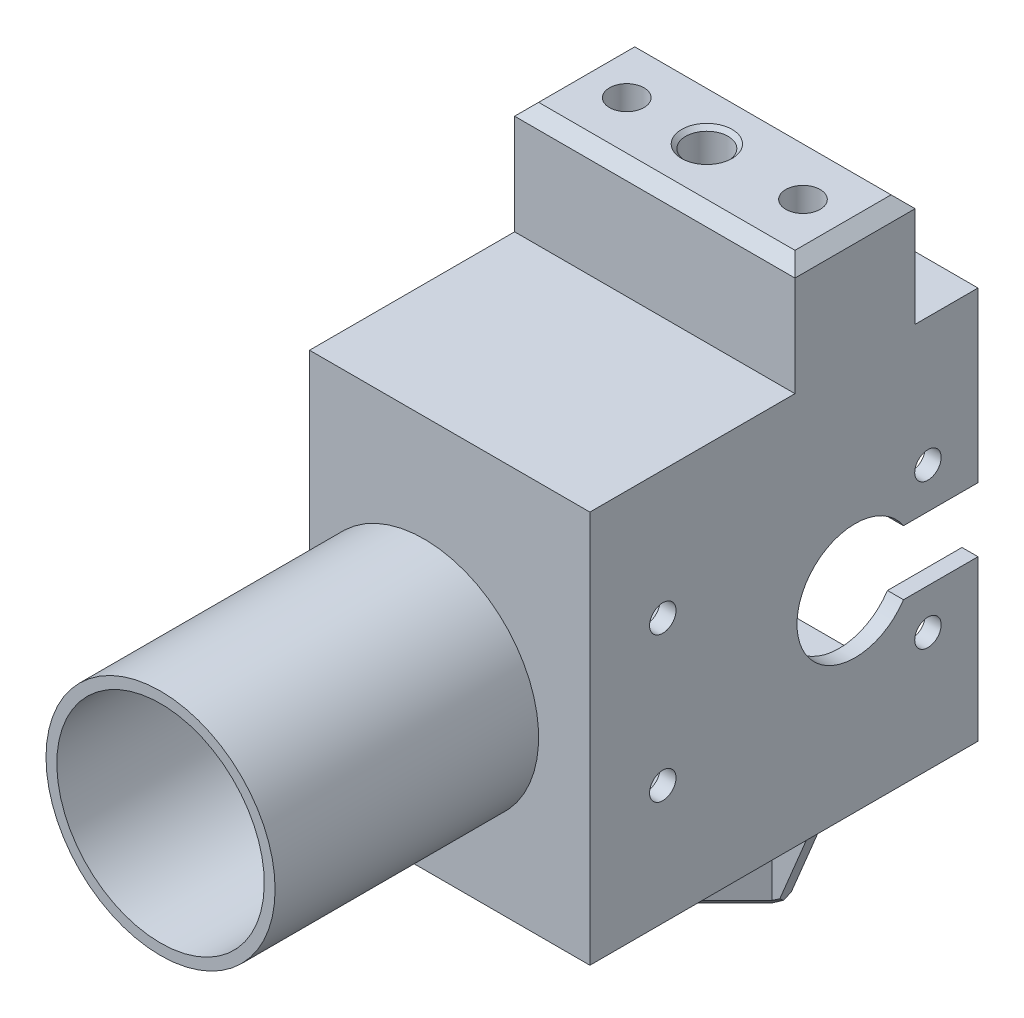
ISO-10303-21;
HEADER;
FILE_DESCRIPTION(('STEP AP214'),'2;1');
FILE_NAME('part.step','',(''),(''),'','','');
FILE_SCHEMA(('AUTOMOTIVE_DESIGN { 1 0 10303 214 1 1 1 1 }'));
ENDSEC;
DATA;
#1=APPLICATION_CONTEXT('core data for automotive mechanical design processes');
#2=APPLICATION_PROTOCOL_DEFINITION('international standard','automotive_design',2000,#1);
#3=PRODUCT_CONTEXT('',#1,'mechanical');
#4=PRODUCT('Part','Part','',(#3));
#5=PRODUCT_RELATED_PRODUCT_CATEGORY('part','',(#4));
#6=PRODUCT_DEFINITION_FORMATION('','',#4);
#7=PRODUCT_DEFINITION_CONTEXT('part definition',#1,'design');
#8=PRODUCT_DEFINITION('design','',#6,#7);
#9=PRODUCT_DEFINITION_SHAPE('','',#8);
#10=(LENGTH_UNIT() NAMED_UNIT(*) SI_UNIT(.MILLI.,.METRE.));
#11=(NAMED_UNIT(*) PLANE_ANGLE_UNIT() SI_UNIT($,.RADIAN.));
#12=(NAMED_UNIT(*) SI_UNIT($,.STERADIAN.) SOLID_ANGLE_UNIT());
#13=UNCERTAINTY_MEASURE_WITH_UNIT(LENGTH_MEASURE(1.E-05),#10,'distance_accuracy_value','');
#14=(GEOMETRIC_REPRESENTATION_CONTEXT(3) GLOBAL_UNCERTAINTY_ASSIGNED_CONTEXT((#13)) GLOBAL_UNIT_ASSIGNED_CONTEXT((#10,
#11,#12)) REPRESENTATION_CONTEXT('',''));
#15=CARTESIAN_POINT('',(0.,0.,0.));
#16=DIRECTION('',(0.,0.,1.));
#17=DIRECTION('',(1.,0.,0.));
#18=AXIS2_PLACEMENT_3D('',#15,#16,#17);
#19=CARTESIAN_POINT('',(-17.5,-24.5,106.666276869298));
#20=DIRECTION('',(0.,1.,0.));
#21=DIRECTION('',(0.,0.,1.));
#22=AXIS2_PLACEMENT_3D('',#19,#20,#21);
#23=PLANE('',#22);
#24=CARTESIAN_POINT('',(-8.50000000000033,-24.5,39.));
#25=DIRECTION('',(0.,-1.,0.));
#26=DIRECTION('',(1.,0.,0.));
#27=AXIS2_PLACEMENT_3D('',#24,#25,#26);
#28=CIRCLE('',#27,2.25);
#29=CARTESIAN_POINT('',(-6.25000000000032,-24.5,39.));
#30=VERTEX_POINT('',#29);
#31=EDGE_CURVE('E719',#30,#30,#28,.T.);
#32=ORIENTED_EDGE('',*,*,#31,.F.);
#33=EDGE_LOOP('',(#32));
#34=FACE_BOUND('',#33,.T.);
#35=CARTESIAN_POINT('',(5.49999999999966,-24.5,6.50000000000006));
#36=DIRECTION('',(0.,-1.,0.));
#37=DIRECTION('',(1.,0.,0.));
#38=AXIS2_PLACEMENT_3D('',#35,#36,#37);
#39=CIRCLE('',#38,2.25);
#40=CARTESIAN_POINT('',(7.74999999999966,-24.5,6.50000000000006));
#41=VERTEX_POINT('',#40);
#42=EDGE_CURVE('E701',#41,#41,#39,.T.);
#43=ORIENTED_EDGE('',*,*,#42,.F.);
#44=EDGE_LOOP('',(#43));
#45=FACE_BOUND('',#44,.T.);
#46=CARTESIAN_POINT('',(-8.50000000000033,-24.5,6.50000000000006));
#47=DIRECTION('',(0.,-1.,0.));
#48=DIRECTION('',(1.,0.,0.));
#49=AXIS2_PLACEMENT_3D('',#46,#47,#48);
#50=CIRCLE('',#49,2.25);
#51=CARTESIAN_POINT('',(-6.25000000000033,-24.5,6.50000000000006));
#52=VERTEX_POINT('',#51);
#53=EDGE_CURVE('E714',#52,#52,#50,.T.);
#54=ORIENTED_EDGE('',*,*,#53,.F.);
#55=EDGE_LOOP('',(#54));
#56=FACE_BOUND('',#55,.T.);
#57=CARTESIAN_POINT('',(5.49999999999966,-24.5,39.));
#58=DIRECTION('',(0.,-1.,0.));
#59=DIRECTION('',(1.,0.,0.));
#60=AXIS2_PLACEMENT_3D('',#57,#58,#59);
#61=CIRCLE('',#60,2.25);
#62=CARTESIAN_POINT('',(7.74999999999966,-24.5,39.));
#63=VERTEX_POINT('',#62);
#64=EDGE_CURVE('E707',#63,#63,#61,.T.);
#65=ORIENTED_EDGE('',*,*,#64,.F.);
#66=EDGE_LOOP('',(#65));
#67=FACE_BOUND('',#66,.T.);
#68=DIRECTION('',(-1.,0.,0.));
#69=VECTOR('',#68,1.);
#70=CARTESIAN_POINT('',(-16.3499999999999,-24.5,16.0571067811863));
#71=LINE('',#70,#69);
#72=CARTESIAN_POINT('',(-9.83883476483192,-24.5,16.0571067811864));
#73=VERTEX_POINT('',#72);
#74=CARTESIAN_POINT('',(-16.3499999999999,-24.5,16.0571067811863));
#75=VERTEX_POINT('',#74);
#76=EDGE_CURVE('E430',#73,#75,#71,.T.);
#77=ORIENTED_EDGE('',*,*,#76,.F.);
#78=DIRECTION('',(-0.707106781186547,0.,-0.707106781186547));
#79=VECTOR('',#78,1.);
#80=CARTESIAN_POINT('',(-0.999999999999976,-24.5,24.8959415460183));
#81=LINE('',#80,#79);
#82=CARTESIAN_POINT('',(-1.70710678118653,-24.5,24.1888347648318));
#83=VERTEX_POINT('',#82);
#84=EDGE_CURVE('E636',#83,#73,#81,.T.);
#85=ORIENTED_EDGE('',*,*,#84,.F.);
#86=DIRECTION('',(0.,0.,-1.));
#87=VECTOR('',#86,1.);
#88=CARTESIAN_POINT('',(-1.70710678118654,-24.5,30.6999999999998));
#89=LINE('',#88,#87);
#90=CARTESIAN_POINT('',(-1.70710678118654,-24.5,30.6999999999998));
#91=VERTEX_POINT('',#90);
#92=EDGE_CURVE('E461',#91,#83,#89,.T.);
#93=ORIENTED_EDGE('',*,*,#92,.F.);
#94=DIRECTION('',(1.,0.,0.));
#95=VECTOR('',#94,1.);
#96=CARTESIAN_POINT('',(-19.501,-24.5,30.6999999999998));
#97=LINE('',#96,#95);
#98=CARTESIAN_POINT('',(-0.292893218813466,-24.5,30.6999999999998));
#99=VERTEX_POINT('',#98);
#100=EDGE_CURVE('E433',#91,#99,#97,.T.);
#101=ORIENTED_EDGE('',*,*,#100,.T.);
#102=DIRECTION('',(0.,0.,1.));
#103=VECTOR('',#102,1.);
#104=CARTESIAN_POINT('',(-0.292893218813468,-24.5,30.6999999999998));
#105=LINE('',#104,#103);
#106=CARTESIAN_POINT('',(-0.292893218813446,-24.5,24.1888347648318));
#107=VERTEX_POINT('',#106);
#108=EDGE_CURVE('E480',#107,#99,#105,.T.);
#109=ORIENTED_EDGE('',*,*,#108,.F.);
#110=DIRECTION('',(-0.707106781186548,0.,0.707106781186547));
#111=VECTOR('',#110,1.);
#112=CARTESIAN_POINT('',(-0.999999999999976,-24.5,24.8959415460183));
#113=LINE('',#112,#111);
#114=CARTESIAN_POINT('',(7.83883476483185,-24.5,16.0571067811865));
#115=VERTEX_POINT('',#114);
#116=EDGE_CURVE('E633',#115,#107,#113,.T.);
#117=ORIENTED_EDGE('',*,*,#116,.F.);
#118=DIRECTION('',(-1.,0.,0.));
#119=VECTOR('',#118,1.);
#120=CARTESIAN_POINT('',(14.3499999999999,-24.5,16.0571067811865));
#121=LINE('',#120,#119);
#122=CARTESIAN_POINT('',(14.3499999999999,-24.5,16.0571067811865));
#123=VERTEX_POINT('',#122);
#124=EDGE_CURVE('E511',#123,#115,#121,.T.);
#125=ORIENTED_EDGE('',*,*,#124,.F.);
#126=DIRECTION('',(0.,0.,-1.));
#127=VECTOR('',#126,1.);
#128=CARTESIAN_POINT('',(14.3499999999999,-24.5,33.8509999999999));
#129=LINE('',#128,#127);
#130=CARTESIAN_POINT('',(14.3499999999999,-24.5,14.6428932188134));
#131=VERTEX_POINT('',#130);
#132=EDGE_CURVE('E483',#123,#131,#129,.T.);
#133=ORIENTED_EDGE('',*,*,#132,.T.);
#134=DIRECTION('',(1.,0.,0.));
#135=VECTOR('',#134,1.);
#136=CARTESIAN_POINT('',(14.3499999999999,-24.5,14.6428932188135));
#137=LINE('',#136,#135);
#138=CARTESIAN_POINT('',(7.83883476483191,-24.5,14.6428932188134));
#139=VERTEX_POINT('',#138);
#140=EDGE_CURVE('E530',#139,#131,#137,.T.);
#141=ORIENTED_EDGE('',*,*,#140,.F.);
#142=DIRECTION('',(0.707106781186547,0.,0.707106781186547));
#143=VECTOR('',#142,1.);
#144=CARTESIAN_POINT('',(8.54594154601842,-24.5,15.3499999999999));
#145=LINE('',#144,#143);
#146=CARTESIAN_POINT('',(-0.292893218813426,-24.5,6.51116523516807));
#147=VERTEX_POINT('',#146);
#148=EDGE_CURVE('E630',#147,#139,#145,.T.);
#149=ORIENTED_EDGE('',*,*,#148,.F.);
#150=DIRECTION('',(0.,0.,1.));
#151=VECTOR('',#150,1.);
#152=CARTESIAN_POINT('',(-0.292893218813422,-24.5,0.));
#153=LINE('',#152,#151);
#154=CARTESIAN_POINT('',(-0.292893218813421,-24.5,0.));
#155=VERTEX_POINT('',#154);
#156=EDGE_CURVE('E575',#155,#147,#153,.T.);
#157=ORIENTED_EDGE('',*,*,#156,.F.);
#158=DIRECTION('',(1.,0.,0.));
#159=VECTOR('',#158,1.);
#160=CARTESIAN_POINT('',(-17.5,-24.5,0.));
#161=LINE('',#160,#159);
#162=CARTESIAN_POINT('',(17.5,-24.5,0.));
#163=VERTEX_POINT('',#162);
#164=EDGE_CURVE('E761',#155,#163,#161,.T.);
#165=ORIENTED_EDGE('',*,*,#164,.T.);
#166=DIRECTION('',(0.,0.,-1.));
#167=VECTOR('',#166,1.);
#168=CARTESIAN_POINT('',(17.5,-24.5,106.666276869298));
#169=LINE('',#168,#167);
#170=CARTESIAN_POINT('',(17.5,-24.5,48.4500000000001));
#171=VERTEX_POINT('',#170);
#172=EDGE_CURVE('E753',#171,#163,#169,.T.);
#173=ORIENTED_EDGE('',*,*,#172,.F.);
#174=DIRECTION('',(1.,0.,0.));
#175=VECTOR('',#174,1.);
#176=CARTESIAN_POINT('',(0.,-24.5,48.4500000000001));
#177=LINE('',#176,#175);
#178=CARTESIAN_POINT('',(-17.5,-24.5,48.4500000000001));
#179=VERTEX_POINT('',#178);
#180=EDGE_CURVE('E692',#179,#171,#177,.T.);
#181=ORIENTED_EDGE('',*,*,#180,.F.);
#182=DIRECTION('',(0.,0.,-1.));
#183=VECTOR('',#182,1.);
#184=CARTESIAN_POINT('',(-17.5,-24.5,106.666276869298));
#185=LINE('',#184,#183);
#186=CARTESIAN_POINT('',(-17.5,-24.5,0.));
#187=VERTEX_POINT('',#186);
#188=EDGE_CURVE('E758',#179,#187,#185,.T.);
#189=ORIENTED_EDGE('',*,*,#188,.T.);
#190=CARTESIAN_POINT('',(-1.70710678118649,-24.5,0.));
#191=VERTEX_POINT('',#190);
#192=EDGE_CURVE('E757',#187,#191,#161,.T.);
#193=ORIENTED_EDGE('',*,*,#192,.T.);
#194=DIRECTION('',(0.,0.,-1.));
#195=VECTOR('',#194,1.);
#196=CARTESIAN_POINT('',(-1.70710678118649,-24.5,0.));
#197=LINE('',#196,#195);
#198=CARTESIAN_POINT('',(-1.70710678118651,-24.5,6.51116523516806));
#199=VERTEX_POINT('',#198);
#200=EDGE_CURVE('E582',#199,#191,#197,.T.);
#201=ORIENTED_EDGE('',*,*,#200,.F.);
#202=DIRECTION('',(0.707106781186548,0.,-0.707106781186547));
#203=VECTOR('',#202,1.);
#204=CARTESIAN_POINT('',(-10.5459415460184,-24.5,15.3499999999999));
#205=LINE('',#204,#203);
#206=CARTESIAN_POINT('',(-9.83883476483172,-24.5,14.6428932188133));
#207=VERTEX_POINT('',#206);
#208=EDGE_CURVE('E639',#207,#199,#205,.T.);
#209=ORIENTED_EDGE('',*,*,#208,.F.);
#210=DIRECTION('',(1.,0.,0.));
#211=VECTOR('',#210,1.);
#212=CARTESIAN_POINT('',(-16.3499999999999,-24.5,14.6428932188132));
#213=LINE('',#212,#211);
#214=CARTESIAN_POINT('',(-16.3499999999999,-24.5,14.6428932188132));
#215=VERTEX_POINT('',#214);
#216=EDGE_CURVE('E62',#215,#207,#213,.T.);
#217=ORIENTED_EDGE('',*,*,#216,.F.);
#218=DIRECTION('',(0.,0.,1.));
#219=VECTOR('',#218,1.);
#220=CARTESIAN_POINT('',(-16.3499999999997,-24.5,-3.15100000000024));
#221=LINE('',#220,#219);
#222=EDGE_CURVE('E57',#215,#75,#221,.T.);
#223=ORIENTED_EDGE('',*,*,#222,.T.);
#224=EDGE_LOOP('',(#77,#85,#93,#101,#109,#117,#125,#133,#141,#149,#157,#165,#173,#181,#189,#193,
#201,#209,#217,#223));
#225=FACE_BOUND('',#224,.T.);
#226=ADVANCED_FACE('F41',(#34,#45,#56,#67,#225),#23,.F.);
#227=CARTESIAN_POINT('',(-0.999999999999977,-39.5,24.8959415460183));
#228=DIRECTION('',(0.707106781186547,0.,-0.707106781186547));
#229=DIRECTION('',(-0.707106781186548,0.,-0.707106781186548));
#230=AXIS2_PLACEMENT_3D('',#227,#228,#229);
#231=PLANE('',#230);
#232=DIRECTION('',(0.707106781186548,0.,0.707106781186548));
#233=VECTOR('',#232,1.);
#234=CARTESIAN_POINT('',(-2.23743686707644,-37.,23.6585046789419));
#235=LINE('',#234,#233);
#236=CARTESIAN_POINT('',(-9.30850467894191,-37.,16.5874368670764));
#237=VERTEX_POINT('',#236);
#238=CARTESIAN_POINT('',(-2.23743686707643,-37.,23.6585046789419));
#239=VERTEX_POINT('',#238);
#240=EDGE_CURVE('E600',#237,#239,#235,.T.);
#241=ORIENTED_EDGE('',*,*,#240,.F.);
#242=DIRECTION('',(0.,-1.,0.));
#243=VECTOR('',#242,1.);
#244=CARTESIAN_POINT('',(-9.3085046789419,-29.,16.5874368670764));
#245=LINE('',#244,#243);
#246=CARTESIAN_POINT('',(-9.30850467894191,-29.,16.5874368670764));
#247=VERTEX_POINT('',#246);
#248=EDGE_CURVE('E604',#247,#237,#245,.T.);
#249=ORIENTED_EDGE('',*,*,#248,.F.);
#250=DIRECTION('',(-0.707106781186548,0.,-0.707106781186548));
#251=VECTOR('',#250,1.);
#252=CARTESIAN_POINT('',(-2.23743686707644,-29.,23.6585046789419));
#253=LINE('',#252,#251);
#254=CARTESIAN_POINT('',(-2.23743686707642,-29.,23.6585046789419));
#255=VERTEX_POINT('',#254);
#256=EDGE_CURVE('E621',#255,#247,#253,.T.);
#257=ORIENTED_EDGE('',*,*,#256,.F.);
#258=DIRECTION('',(0.,1.,0.));
#259=VECTOR('',#258,1.);
#260=CARTESIAN_POINT('',(-2.23743686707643,-29.,23.6585046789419));
#261=LINE('',#260,#259);
#262=EDGE_CURVE('E598',#239,#255,#261,.T.);
#263=ORIENTED_EDGE('',*,*,#262,.F.);
#264=EDGE_LOOP('',(#241,#249,#257,#263));
#265=FACE_BOUND('',#264,.T.);
#266=DIRECTION('',(0.,1.,0.));
#267=VECTOR('',#266,1.);
#268=CARTESIAN_POINT('',(-9.83883476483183,-38.5,16.0571067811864));
#269=LINE('',#268,#267);
#270=CARTESIAN_POINT('',(-9.83883476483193,-38.5,16.0571067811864));
#271=VERTEX_POINT('',#270);
#272=EDGE_CURVE('E422',#271,#73,#269,.T.);
#273=ORIENTED_EDGE('',*,*,#272,.F.);
#274=DIRECTION('',(0.707106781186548,0.,0.707106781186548));
#275=VECTOR('',#274,1.);
#276=CARTESIAN_POINT('',(-0.999999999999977,-38.5,24.8959415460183));
#277=LINE('',#276,#275);
#278=CARTESIAN_POINT('',(-1.70710678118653,-38.5,24.1888347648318));
#279=VERTEX_POINT('',#278);
#280=EDGE_CURVE('E827',#271,#279,#277,.T.);
#281=ORIENTED_EDGE('',*,*,#280,.T.);
#282=DIRECTION('',(0.,1.,0.));
#283=VECTOR('',#282,1.);
#284=CARTESIAN_POINT('',(-1.70710678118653,-38.5,24.1888347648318));
#285=LINE('',#284,#283);
#286=EDGE_CURVE('E464',#279,#83,#285,.T.);
#287=ORIENTED_EDGE('',*,*,#286,.T.);
#288=ORIENTED_EDGE('',*,*,#84,.T.);
#289=EDGE_LOOP('',(#273,#281,#287,#288));
#290=FACE_BOUND('',#289,.T.);
#291=ADVANCED_FACE('F978',(#265,#290),#231,.F.);
#292=CARTESIAN_POINT('',(-10.5459415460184,-39.5,15.3499999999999));
#293=DIRECTION('',(0.707106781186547,0.,0.707106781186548));
#294=DIRECTION('',(0.707106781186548,0.,-0.707106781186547));
#295=AXIS2_PLACEMENT_3D('',#292,#293,#294);
#296=PLANE('',#295);
#297=DIRECTION('',(0.,1.,0.));
#298=VECTOR('',#297,1.);
#299=CARTESIAN_POINT('',(-9.83883476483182,-38.5,14.6428932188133));
#300=LINE('',#299,#298);
#301=CARTESIAN_POINT('',(-9.83883476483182,-38.5,14.6428932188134));
#302=VERTEX_POINT('',#301);
#303=EDGE_CURVE('E1269',#302,#207,#300,.T.);
#304=ORIENTED_EDGE('',*,*,#303,.T.);
#305=ORIENTED_EDGE('',*,*,#208,.T.);
#306=DIRECTION('',(0.,1.,0.));
#307=VECTOR('',#306,1.);
#308=CARTESIAN_POINT('',(-1.70710678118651,-38.5,6.51116523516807));
#309=LINE('',#308,#307);
#310=CARTESIAN_POINT('',(-1.70710678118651,-38.5,6.51116523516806));
#311=VERTEX_POINT('',#310);
#312=EDGE_CURVE('E588',#311,#199,#309,.T.);
#313=ORIENTED_EDGE('',*,*,#312,.F.);
#314=DIRECTION('',(-0.707106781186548,0.,0.707106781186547));
#315=VECTOR('',#314,1.);
#316=CARTESIAN_POINT('',(-10.5459415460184,-38.5,15.3499999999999));
#317=LINE('',#316,#315);
#318=EDGE_CURVE('E823',#311,#302,#317,.T.);
#319=ORIENTED_EDGE('',*,*,#318,.T.);
#320=EDGE_LOOP('',(#304,#305,#313,#319));
#321=FACE_BOUND('',#320,.T.);
#322=ADVANCED_FACE('F984',(#321),#296,.F.);
#323=CARTESIAN_POINT('',(-0.999999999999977,-39.5,24.8959415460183));
#324=DIRECTION('',(-0.707106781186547,0.,-0.707106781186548));
#325=DIRECTION('',(-0.707106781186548,0.,0.707106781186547));
#326=AXIS2_PLACEMENT_3D('',#323,#324,#325);
#327=PLANE('',#326);
#328=DIRECTION('',(0.,1.,0.));
#329=VECTOR('',#328,1.);
#330=CARTESIAN_POINT('',(-0.292893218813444,-38.5,24.1888347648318));
#331=LINE('',#330,#329);
#332=CARTESIAN_POINT('',(-0.292893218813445,-38.5,24.1888347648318));
#333=VERTEX_POINT('',#332);
#334=EDGE_CURVE('E477',#333,#107,#331,.T.);
#335=ORIENTED_EDGE('',*,*,#334,.F.);
#336=DIRECTION('',(0.707106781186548,0.,-0.707106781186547));
#337=VECTOR('',#336,1.);
#338=CARTESIAN_POINT('',(7.83883476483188,-38.5,16.0571067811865));
#339=LINE('',#338,#337);
#340=CARTESIAN_POINT('',(7.83883476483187,-38.5,16.0571067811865));
#341=VERTEX_POINT('',#340);
#342=EDGE_CURVE('E895',#333,#341,#339,.T.);
#343=ORIENTED_EDGE('',*,*,#342,.T.);
#344=DIRECTION('',(0.,1.,0.));
#345=VECTOR('',#344,1.);
#346=CARTESIAN_POINT('',(7.83883476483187,-38.5,16.0571067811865));
#347=LINE('',#346,#345);
#348=EDGE_CURVE('E514',#341,#115,#347,.T.);
#349=ORIENTED_EDGE('',*,*,#348,.T.);
#350=ORIENTED_EDGE('',*,*,#116,.T.);
#351=EDGE_LOOP('',(#335,#343,#349,#350));
#352=FACE_BOUND('',#351,.T.);
#353=ADVANCED_FACE('F1106',(#352),#327,.F.);
#354=CARTESIAN_POINT('',(8.54594154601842,-39.5,15.3499999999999));
#355=DIRECTION('',(-0.707106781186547,0.,0.707106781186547));
#356=DIRECTION('',(0.707106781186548,0.,0.707106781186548));
#357=AXIS2_PLACEMENT_3D('',#354,#355,#356);
#358=PLANE('',#357);
#359=DIRECTION('',(0.707106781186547,0.,0.707106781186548));
#360=VECTOR('',#359,1.);
#361=CARTESIAN_POINT('',(7.30850467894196,-29.,14.1125631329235));
#362=LINE('',#361,#360);
#363=CARTESIAN_POINT('',(0.237436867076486,-29.,7.04149532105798));
#364=VERTEX_POINT('',#363);
#365=CARTESIAN_POINT('',(7.30850467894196,-29.,14.1125631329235));
#366=VERTEX_POINT('',#365);
#367=EDGE_CURVE('E609',#364,#366,#362,.T.);
#368=ORIENTED_EDGE('',*,*,#367,.F.);
#369=DIRECTION('',(0.,1.,0.));
#370=VECTOR('',#369,1.);
#371=CARTESIAN_POINT('',(0.237436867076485,-29.,7.04149532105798));
#372=LINE('',#371,#370);
#373=CARTESIAN_POINT('',(0.237436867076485,-37.,7.04149532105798));
#374=VERTEX_POINT('',#373);
#375=EDGE_CURVE('E607',#374,#364,#372,.T.);
#376=ORIENTED_EDGE('',*,*,#375,.F.);
#377=DIRECTION('',(-0.707106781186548,0.,-0.707106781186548));
#378=VECTOR('',#377,1.);
#379=CARTESIAN_POINT('',(7.30850467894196,-37.,14.1125631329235));
#380=LINE('',#379,#378);
#381=CARTESIAN_POINT('',(7.30850467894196,-37.,14.1125631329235));
#382=VERTEX_POINT('',#381);
#383=EDGE_CURVE('E615',#382,#374,#380,.T.);
#384=ORIENTED_EDGE('',*,*,#383,.F.);
#385=DIRECTION('',(0.,-1.,0.));
#386=VECTOR('',#385,1.);
#387=CARTESIAN_POINT('',(7.30850467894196,-29.,14.1125631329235));
#388=LINE('',#387,#386);
#389=EDGE_CURVE('E612',#366,#382,#388,.T.);
#390=ORIENTED_EDGE('',*,*,#389,.F.);
#391=EDGE_LOOP('',(#368,#376,#384,#390));
#392=FACE_BOUND('',#391,.T.);
#393=DIRECTION('',(0.,1.,0.));
#394=VECTOR('',#393,1.);
#395=CARTESIAN_POINT('',(7.83883476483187,-38.5,14.6428932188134));
#396=LINE('',#395,#394);
#397=CARTESIAN_POINT('',(7.83883476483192,-38.5,14.6428932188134));
#398=VERTEX_POINT('',#397);
#399=EDGE_CURVE('E527',#398,#139,#396,.T.);
#400=ORIENTED_EDGE('',*,*,#399,.F.);
#401=DIRECTION('',(-0.707106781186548,0.,-0.707106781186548));
#402=VECTOR('',#401,1.);
#403=CARTESIAN_POINT('',(-0.999999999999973,-38.5,5.80405845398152));
#404=LINE('',#403,#402);
#405=CARTESIAN_POINT('',(-0.292893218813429,-38.5,6.51116523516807));
#406=VERTEX_POINT('',#405);
#407=EDGE_CURVE('E819',#398,#406,#404,.T.);
#408=ORIENTED_EDGE('',*,*,#407,.T.);
#409=DIRECTION('',(0.,1.,0.));
#410=VECTOR('',#409,1.);
#411=CARTESIAN_POINT('',(-0.292893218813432,-38.5,6.51116523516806));
#412=LINE('',#411,#410);
#413=EDGE_CURVE('E595',#406,#147,#412,.T.);
#414=ORIENTED_EDGE('',*,*,#413,.T.);
#415=ORIENTED_EDGE('',*,*,#148,.T.);
#416=EDGE_LOOP('',(#400,#408,#414,#415));
#417=FACE_BOUND('',#416,.T.);
#418=ADVANCED_FACE('F1111',(#392,#417),#358,.F.);
#419=CARTESIAN_POINT('',(0.,0.,0.));
#420=DIRECTION('',(0.,0.,-1.));
#421=DIRECTION('',(-1.,0.,0.));
#422=AXIS2_PLACEMENT_3D('',#419,#420,#421);
#423=PLANE('',#422);
#424=DIRECTION('',(1.,0.,0.));
#425=VECTOR('',#424,1.);
#426=CARTESIAN_POINT('',(-17.5,3.45000000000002,0.));
#427=LINE('',#426,#425);
#428=CARTESIAN_POINT('',(-17.5,3.45000000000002,0.));
#429=VERTEX_POINT('',#428);
#430=CARTESIAN_POINT('',(-15.5,3.45000000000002,0.));
#431=VERTEX_POINT('',#430);
#432=EDGE_CURVE('E544',#429,#431,#427,.T.);
#433=ORIENTED_EDGE('',*,*,#432,.F.);
#434=DIRECTION('',(0.,-1.,0.));
#435=VECTOR('',#434,1.);
#436=CARTESIAN_POINT('',(-17.5,24.5,0.));
#437=LINE('',#436,#435);
#438=CARTESIAN_POINT('',(-17.5,24.5,0.));
#439=VERTEX_POINT('',#438);
#440=EDGE_CURVE('E762',#439,#429,#437,.T.);
#441=ORIENTED_EDGE('',*,*,#440,.F.);
#442=DIRECTION('',(-1.,0.,0.));
#443=VECTOR('',#442,1.);
#444=CARTESIAN_POINT('',(-17.5,24.5,0.));
#445=LINE('',#444,#443);
#446=CARTESIAN_POINT('',(17.5,24.5,0.));
#447=VERTEX_POINT('',#446);
#448=EDGE_CURVE('E751',#447,#439,#445,.T.);
#449=ORIENTED_EDGE('',*,*,#448,.F.);
#450=DIRECTION('',(0.,1.,0.));
#451=VECTOR('',#450,1.);
#452=CARTESIAN_POINT('',(17.5,24.5,0.));
#453=LINE('',#452,#451);
#454=CARTESIAN_POINT('',(17.5,3.45000000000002,0.));
#455=VERTEX_POINT('',#454);
#456=EDGE_CURVE('E756',#455,#447,#453,.T.);
#457=ORIENTED_EDGE('',*,*,#456,.F.);
#458=CARTESIAN_POINT('',(15.5,3.45000000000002,0.));
#459=VERTEX_POINT('',#458);
#460=EDGE_CURVE('E547',#459,#455,#427,.T.);
#461=ORIENTED_EDGE('',*,*,#460,.F.);
#462=DIRECTION('',(0.,1.,0.));
#463=VECTOR('',#462,1.);
#464=CARTESIAN_POINT('',(15.5,22.5,0.));
#465=LINE('',#464,#463);
#466=CARTESIAN_POINT('',(15.5,22.5,0.));
#467=VERTEX_POINT('',#466);
#468=EDGE_CURVE('E773',#459,#467,#465,.T.);
#469=ORIENTED_EDGE('',*,*,#468,.T.);
#470=DIRECTION('',(-1.,0.,0.));
#471=VECTOR('',#470,1.);
#472=CARTESIAN_POINT('',(-15.5,22.5,0.));
#473=LINE('',#472,#471);
#474=CARTESIAN_POINT('',(-15.5,22.5,0.));
#475=VERTEX_POINT('',#474);
#476=EDGE_CURVE('E772',#467,#475,#473,.T.);
#477=ORIENTED_EDGE('',*,*,#476,.T.);
#478=DIRECTION('',(0.,-1.,0.));
#479=VECTOR('',#478,1.);
#480=CARTESIAN_POINT('',(-15.5,22.5,0.));
#481=LINE('',#480,#479);
#482=EDGE_CURVE('E777',#475,#431,#481,.T.);
#483=ORIENTED_EDGE('',*,*,#482,.T.);
#484=EDGE_LOOP('',(#433,#441,#449,#457,#461,#469,#477,#483));
#485=FACE_BOUND('',#484,.T.);
#486=ADVANCED_FACE('F920',(#485),#423,.T.);
#487=CARTESIAN_POINT('',(17.501,-3.59329642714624,-8.66740925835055));
#488=DIRECTION('',(0.,-0.382968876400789,-0.923761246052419));
#489=DIRECTION('',(0.,0.923761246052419,-0.382968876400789));
#490=AXIS2_PLACEMENT_3D('',#487,#488,#489);
#491=PLANE('',#490);
#492=DIRECTION('',(1.,0.,0.));
#493=VECTOR('',#492,1.);
#494=CARTESIAN_POINT('',(0.,-38.5,5.80405845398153));
#495=LINE('',#494,#493);
#496=CARTESIAN_POINT('',(-1.00710678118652,-38.5,5.80405845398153));
#497=VERTEX_POINT('',#496);
#498=CARTESIAN_POINT('',(-0.999999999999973,-38.5,5.80405845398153));
#499=VERTEX_POINT('',#498);
#500=EDGE_CURVE('E830',#497,#499,#495,.T.);
#501=ORIENTED_EDGE('',*,*,#500,.F.);
#502=DIRECTION('',(-0.707106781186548,0.653197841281,-0.270799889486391));
#503=VECTOR('',#502,1.);
#504=CARTESIAN_POINT('',(-10.6468442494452,-29.5951841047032,2.11233902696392));
#505=LINE('',#504,#503);
#506=CARTESIAN_POINT('',(-1.70710678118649,-37.8533671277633,5.53598024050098));
#507=VERTEX_POINT('',#506);
#508=EDGE_CURVE('E849',#497,#507,#505,.T.);
#509=ORIENTED_EDGE('',*,*,#508,.T.);
#510=DIRECTION('',(0.,-0.923761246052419,0.382968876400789));
#511=VECTOR('',#510,1.);
#512=CARTESIAN_POINT('',(-1.70710678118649,-3.59329642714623,-8.66740925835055));
#513=LINE('',#512,#511);
#514=EDGE_CURVE('E567',#191,#507,#513,.T.);
#515=ORIENTED_EDGE('',*,*,#514,.F.);
#516=DIRECTION('',(-1.,0.,0.));
#517=VECTOR('',#516,1.);
#518=CARTESIAN_POINT('',(17.501,-24.5,0.));
#519=LINE('',#518,#517);
#520=EDGE_CURVE('E571',#155,#191,#519,.T.);
#521=ORIENTED_EDGE('',*,*,#520,.F.);
#522=DIRECTION('',(0.,0.923761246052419,-0.382968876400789));
#523=VECTOR('',#522,1.);
#524=CARTESIAN_POINT('',(-0.292893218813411,-3.59329642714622,-8.66740925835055));
#525=LINE('',#524,#523);
#526=CARTESIAN_POINT('',(-0.292893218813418,-37.8533671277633,5.53598024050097));
#527=VERTEX_POINT('',#526);
#528=EDGE_CURVE('E565',#527,#155,#525,.T.);
#529=ORIENTED_EDGE('',*,*,#528,.F.);
#530=DIRECTION('',(0.707106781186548,0.653197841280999,-0.270799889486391));
#531=VECTOR('',#530,1.);
#532=CARTESIAN_POINT('',(27.1478442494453,-12.5046772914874,-4.97296815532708));
#533=LINE('',#532,#531);
#534=CARTESIAN_POINT('',(-0.99289321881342,-38.5,5.80405845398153));
#535=VERTEX_POINT('',#534);
#536=EDGE_CURVE('E841',#535,#527,#533,.T.);
#537=ORIENTED_EDGE('',*,*,#536,.F.);
#538=DIRECTION('',(-1.,0.,0.));
#539=VECTOR('',#538,1.);
#540=CARTESIAN_POINT('',(17.501,-38.5,5.80405845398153));
#541=LINE('',#540,#539);
#542=EDGE_CURVE('E572',#535,#499,#541,.T.);
#543=ORIENTED_EDGE('',*,*,#542,.T.);
#544=EDGE_LOOP('',(#501,#509,#515,#521,#529,#537,#543));
#545=FACE_BOUND('',#544,.T.);
#546=ADVANCED_FACE('F1233',(#545),#491,.T.);
#547=CARTESIAN_POINT('',(0.,-38.5,0.));
#548=DIRECTION('',(0.,-1.,0.));
#549=DIRECTION('',(1.,0.,0.));
#550=AXIS2_PLACEMENT_3D('',#547,#548,#549);
#551=PLANE('',#550);
#552=DIRECTION('',(0.,0.,-1.));
#553=VECTOR('',#552,1.);
#554=CARTESIAN_POINT('',(-1.70710678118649,-38.5,0.));
#555=LINE('',#554,#553);
#556=CARTESIAN_POINT('',(-1.70710678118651,-38.5,6.50405845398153));
#557=VERTEX_POINT('',#556);
#558=EDGE_CURVE('E585',#311,#557,#555,.T.);
#559=ORIENTED_EDGE('',*,*,#558,.T.);
#560=DIRECTION('',(0.707106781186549,0.,-0.707106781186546));
#561=VECTOR('',#560,1.);
#562=CARTESIAN_POINT('',(2.39847583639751,-38.5,2.39847583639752));
#563=LINE('',#562,#561);
#564=EDGE_CURVE('E846',#557,#497,#563,.T.);
#565=ORIENTED_EDGE('',*,*,#564,.T.);
#566=ORIENTED_EDGE('',*,*,#500,.T.);
#567=EDGE_CURVE('E824',#499,#311,#317,.T.);
#568=ORIENTED_EDGE('',*,*,#567,.T.);
#569=EDGE_LOOP('',(#559,#565,#566,#568));
#570=FACE_BOUND('',#569,.T.);
#571=ADVANCED_FACE('F1229',(#570),#551,.T.);
#572=CARTESIAN_POINT('',(-0.292893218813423,-38.5,0.));
#573=DIRECTION('',(-1.,0.,0.));
#574=DIRECTION('',(0.,0.,1.));
#575=AXIS2_PLACEMENT_3D('',#572,#573,#574);
#576=PLANE('',#575);
#577=DIRECTION('',(0.,0.,1.));
#578=VECTOR('',#577,1.);
#579=CARTESIAN_POINT('',(-0.292893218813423,-38.5,0.));
#580=LINE('',#579,#578);
#581=CARTESIAN_POINT('',(-0.292893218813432,-38.5,6.50405845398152));
#582=VERTEX_POINT('',#581);
#583=EDGE_CURVE('E578',#582,#406,#580,.T.);
#584=ORIENTED_EDGE('',*,*,#583,.F.);
#585=DIRECTION('',(0.,0.555441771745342,-0.831555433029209));
#586=VECTOR('',#585,1.);
#587=CARTESIAN_POINT('',(-0.292893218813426,-35.4959014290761,2.00660324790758));
#588=LINE('',#587,#586);
#589=EDGE_CURVE('E835',#582,#527,#588,.T.);
#590=ORIENTED_EDGE('',*,*,#589,.T.);
#591=ORIENTED_EDGE('',*,*,#528,.T.);
#592=ORIENTED_EDGE('',*,*,#156,.T.);
#593=ORIENTED_EDGE('',*,*,#413,.F.);
#594=EDGE_LOOP('',(#584,#590,#591,#592,#593));
#595=FACE_BOUND('',#594,.T.);
#596=ADVANCED_FACE('F997',(#595),#576,.F.);
#597=DIRECTION('',(1.,0.,0.));
#598=VECTOR('',#597,1.);
#599=CARTESIAN_POINT('',(-17.5,-4.54999999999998,0.));
#600=LINE('',#599,#598);
#601=CARTESIAN_POINT('',(15.5,-4.54999999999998,0.));
#602=VERTEX_POINT('',#601);
#603=CARTESIAN_POINT('',(17.5,-4.54999999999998,0.));
#604=VERTEX_POINT('',#603);
#605=EDGE_CURVE('E541',#602,#604,#600,.T.);
#606=ORIENTED_EDGE('',*,*,#605,.T.);
#607=EDGE_CURVE('E747',#163,#604,#453,.T.);
#608=ORIENTED_EDGE('',*,*,#607,.F.);
#609=ORIENTED_EDGE('',*,*,#164,.F.);
#610=ORIENTED_EDGE('',*,*,#520,.T.);
#611=ORIENTED_EDGE('',*,*,#192,.F.);
#612=CARTESIAN_POINT('',(-17.5,-4.54999999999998,0.));
#613=VERTEX_POINT('',#612);
#614=EDGE_CURVE('E766',#613,#187,#437,.T.);
#615=ORIENTED_EDGE('',*,*,#614,.F.);
#616=CARTESIAN_POINT('',(-15.5,-4.54999999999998,0.));
#617=VERTEX_POINT('',#616);
#618=EDGE_CURVE('E548',#613,#617,#600,.T.);
#619=ORIENTED_EDGE('',*,*,#618,.T.);
#620=CARTESIAN_POINT('',(-15.5,-22.5,0.));
#621=VERTEX_POINT('',#620);
#622=EDGE_CURVE('E776',#617,#621,#481,.T.);
#623=ORIENTED_EDGE('',*,*,#622,.T.);
#624=DIRECTION('',(1.,0.,0.));
#625=VECTOR('',#624,1.);
#626=CARTESIAN_POINT('',(-15.5,-22.5,0.));
#627=LINE('',#626,#625);
#628=CARTESIAN_POINT('',(15.5,-22.5,0.));
#629=VERTEX_POINT('',#628);
#630=EDGE_CURVE('E722',#621,#629,#627,.T.);
#631=ORIENTED_EDGE('',*,*,#630,.T.);
#632=EDGE_CURVE('E769',#629,#602,#465,.T.);
#633=ORIENTED_EDGE('',*,*,#632,.T.);
#634=EDGE_LOOP('',(#606,#608,#609,#610,#611,#615,#619,#623,#631,#633));
#635=FACE_BOUND('',#634,.T.);
#636=ADVANCED_FACE('F993',(#635),#423,.T.);
#637=CARTESIAN_POINT('',(-1.70710678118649,-38.5,0.));
#638=DIRECTION('',(1.,0.,0.));
#639=DIRECTION('',(0.,0.,-1.));
#640=AXIS2_PLACEMENT_3D('',#637,#638,#639);
#641=PLANE('',#640);
#642=DIRECTION('',(0.,0.555441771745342,-0.831555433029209));
#643=VECTOR('',#642,1.);
#644=CARTESIAN_POINT('',(-1.7071067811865,-35.4959014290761,2.00660324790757));
#645=LINE('',#644,#643);
#646=EDGE_CURVE('E844',#557,#507,#645,.T.);
#647=ORIENTED_EDGE('',*,*,#646,.F.);
#648=ORIENTED_EDGE('',*,*,#558,.F.);
#649=ORIENTED_EDGE('',*,*,#312,.T.);
#650=ORIENTED_EDGE('',*,*,#200,.T.);
#651=ORIENTED_EDGE('',*,*,#514,.T.);
#652=EDGE_LOOP('',(#647,#648,#649,#650,#651));
#653=FACE_BOUND('',#652,.T.);
#654=ADVANCED_FACE('F996',(#653),#641,.F.);
#655=DIRECTION('',(-0.707106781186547,0.,-0.707106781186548));
#656=VECTOR('',#655,1.);
#657=CARTESIAN_POINT('',(-3.39847583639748,-38.5,3.39847583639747));
#658=LINE('',#657,#656);
#659=EDGE_CURVE('E838',#582,#535,#658,.T.);
#660=ORIENTED_EDGE('',*,*,#659,.F.);
#661=ORIENTED_EDGE('',*,*,#583,.T.);
#662=DIRECTION('',(-0.707106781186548,0.,-0.707106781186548));
#663=VECTOR('',#662,1.);
#664=CARTESIAN_POINT('',(-3.40202922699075,-38.5,3.40202922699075));
#665=LINE('',#664,#663);
#666=EDGE_CURVE('E581',#406,#499,#665,.T.);
#667=ORIENTED_EDGE('',*,*,#666,.T.);
#668=ORIENTED_EDGE('',*,*,#542,.F.);
#669=EDGE_LOOP('',(#660,#661,#667,#668));
#670=FACE_BOUND('',#669,.T.);
#671=ADVANCED_FACE('F1360',(#670),#551,.T.);
#672=CARTESIAN_POINT('',(-17.5,24.5,106.666276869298));
#673=DIRECTION('',(0.,-1.,0.));
#674=DIRECTION('',(0.,0.,-1.));
#675=AXIS2_PLACEMENT_3D('',#672,#673,#674);
#676=PLANE('',#675);
#677=DIRECTION('',(1.,0.,0.));
#678=VECTOR('',#677,1.);
#679=CARTESIAN_POINT('',(-17.5,24.5,22.8500000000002));
#680=LINE('',#679,#678);
#681=CARTESIAN_POINT('',(-17.5,24.5,22.8500000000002));
#682=VERTEX_POINT('',#681);
#683=CARTESIAN_POINT('',(17.5,24.5,22.8500000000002));
#684=VERTEX_POINT('',#683);
#685=EDGE_CURVE('E656',#682,#684,#680,.T.);
#686=ORIENTED_EDGE('',*,*,#685,.F.);
#687=DIRECTION('',(0.,0.,-1.));
#688=VECTOR('',#687,1.);
#689=CARTESIAN_POINT('',(-17.5,24.5,106.666276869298));
#690=LINE('',#689,#688);
#691=CARTESIAN_POINT('',(-17.5,24.5,48.4500000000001));
#692=VERTEX_POINT('',#691);
#693=EDGE_CURVE('E763',#692,#682,#690,.T.);
#694=ORIENTED_EDGE('',*,*,#693,.F.);
#695=DIRECTION('',(-1.,0.,0.));
#696=VECTOR('',#695,1.);
#697=CARTESIAN_POINT('',(0.,24.5,48.4500000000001));
#698=LINE('',#697,#696);
#699=CARTESIAN_POINT('',(17.5,24.5,48.4500000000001));
#700=VERTEX_POINT('',#699);
#701=EDGE_CURVE('E685',#700,#692,#698,.T.);
#702=ORIENTED_EDGE('',*,*,#701,.F.);
#703=DIRECTION('',(0.,0.,-1.));
#704=VECTOR('',#703,1.);
#705=CARTESIAN_POINT('',(17.5,24.5,106.666276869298));
#706=LINE('',#705,#704);
#707=EDGE_CURVE('E748',#700,#684,#706,.T.);
#708=ORIENTED_EDGE('',*,*,#707,.T.);
#709=EDGE_LOOP('',(#686,#694,#702,#708));
#710=FACE_BOUND('',#709,.T.);
#711=ADVANCED_FACE('F991',(#710),#676,.F.);
#712=DIRECTION('',(-1.,0.,0.));
#713=VECTOR('',#712,1.);
#714=CARTESIAN_POINT('',(-17.5,24.5,7.85000000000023));
#715=LINE('',#714,#713);
#716=CARTESIAN_POINT('',(17.5,24.5,7.85000000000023));
#717=VERTEX_POINT('',#716);
#718=CARTESIAN_POINT('',(-17.5,24.5,7.85000000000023));
#719=VERTEX_POINT('',#718);
#720=EDGE_CURVE('E649',#717,#719,#715,.T.);
#721=ORIENTED_EDGE('',*,*,#720,.F.);
#722=EDGE_CURVE('E752',#717,#447,#706,.T.);
#723=ORIENTED_EDGE('',*,*,#722,.T.);
#724=ORIENTED_EDGE('',*,*,#448,.T.);
#725=EDGE_CURVE('E767',#719,#439,#690,.T.);
#726=ORIENTED_EDGE('',*,*,#725,.F.);
#727=EDGE_LOOP('',(#721,#723,#724,#726));
#728=FACE_BOUND('',#727,.T.);
#729=ADVANCED_FACE('F930',(#728),#676,.F.);
#730=CARTESIAN_POINT('',(0.,0.,48.4500000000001));
#731=DIRECTION('',(0.,0.,1.));
#732=DIRECTION('',(1.,0.,0.));
#733=AXIS2_PLACEMENT_3D('',#730,#731,#732);
#734=PLANE('',#733);
#735=DIRECTION('',(0.,-1.,0.));
#736=VECTOR('',#735,1.);
#737=CARTESIAN_POINT('',(-17.5,0.,48.4500000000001));
#738=LINE('',#737,#736);
#739=CARTESIAN_POINT('',(-17.5,-3.05,48.45));
#740=VERTEX_POINT('',#739);
#741=EDGE_CURVE('E689',#692,#740,#738,.T.);
#742=ORIENTED_EDGE('',*,*,#741,.T.);
#743=CARTESIAN_POINT('',(-3.20000000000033,-3.05,48.45));
#744=DIRECTION('',(0.,0.,1.));
#745=DIRECTION('',(1.,0.,0.));
#746=AXIS2_PLACEMENT_3D('',#743,#744,#745);
#747=CIRCLE('',#746,14.2999999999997);
#748=EDGE_CURVE('E671',#740,#740,#747,.F.);
#749=ORIENTED_EDGE('',*,*,#748,.T.);
#750=EDGE_CURVE('E688',#740,#179,#738,.T.);
#751=ORIENTED_EDGE('',*,*,#750,.T.);
#752=ORIENTED_EDGE('',*,*,#180,.T.);
#753=DIRECTION('',(0.,1.,0.));
#754=VECTOR('',#753,1.);
#755=CARTESIAN_POINT('',(17.5,0.,48.4500000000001));
#756=LINE('',#755,#754);
#757=EDGE_CURVE('E695',#171,#700,#756,.T.);
#758=ORIENTED_EDGE('',*,*,#757,.T.);
#759=ORIENTED_EDGE('',*,*,#701,.T.);
#760=EDGE_LOOP('',(#742,#749,#751,#752,#758,#759));
#761=FACE_BOUND('',#760,.T.);
#762=ADVANCED_FACE('F1017',(#761),#734,.T.);
#763=CARTESIAN_POINT('',(-17.5,24.5,106.666276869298));
#764=DIRECTION('',(1.,0.,0.));
#765=DIRECTION('',(0.,1.,0.));
#766=AXIS2_PLACEMENT_3D('',#763,#764,#765);
#767=PLANE('',#766);
#768=ORIENTED_EDGE('',*,*,#440,.T.);
#769=DIRECTION('',(0.,0.,1.));
#770=VECTOR('',#769,1.);
#771=CARTESIAN_POINT('',(-17.5,3.45000000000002,15.3500000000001));
#772=LINE('',#771,#770);
#773=CARTESIAN_POINT('',(-17.5,3.45000000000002,9.30330668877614));
#774=VERTEX_POINT('',#773);
#775=EDGE_CURVE('E537',#429,#774,#772,.T.);
#776=ORIENTED_EDGE('',*,*,#775,.T.);
#777=CARTESIAN_POINT('',(-17.5,-0.549999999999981,15.3500000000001));
#778=DIRECTION('',(1.,0.,0.));
#779=DIRECTION('',(0.,1.,0.));
#780=AXIS2_PLACEMENT_3D('',#777,#778,#779);
#781=CIRCLE('',#780,7.25);
#782=CARTESIAN_POINT('',(-17.5,-4.54999999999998,9.30330668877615));
#783=VERTEX_POINT('',#782);
#784=EDGE_CURVE('E728',#783,#774,#781,.F.);
#785=ORIENTED_EDGE('',*,*,#784,.F.);
#786=DIRECTION('',(0.,0.,-1.));
#787=VECTOR('',#786,1.);
#788=CARTESIAN_POINT('',(-17.5,-4.54999999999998,15.3500000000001));
#789=LINE('',#788,#787);
#790=EDGE_CURVE('E534',#783,#613,#789,.T.);
#791=ORIENTED_EDGE('',*,*,#790,.T.);
#792=ORIENTED_EDGE('',*,*,#614,.T.);
#793=ORIENTED_EDGE('',*,*,#188,.F.);
#794=ORIENTED_EDGE('',*,*,#750,.F.);
#795=ORIENTED_EDGE('',*,*,#741,.F.);
#796=ORIENTED_EDGE('',*,*,#693,.T.);
#797=DIRECTION('',(0.,-1.,0.));
#798=VECTOR('',#797,1.);
#799=CARTESIAN_POINT('',(-17.5,38.5,22.8500000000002));
#800=LINE('',#799,#798);
#801=CARTESIAN_POINT('',(-17.5,37.,22.8500000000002));
#802=VERTEX_POINT('',#801);
#803=EDGE_CURVE('E661',#802,#682,#800,.T.);
#804=ORIENTED_EDGE('',*,*,#803,.F.);
#805=DIRECTION('',(0.,0.,-1.));
#806=VECTOR('',#805,1.);
#807=CARTESIAN_POINT('',(-17.5,37.,7.85000000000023));
#808=LINE('',#807,#806);
#809=CARTESIAN_POINT('',(-17.5,37.,7.85000000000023));
#810=VERTEX_POINT('',#809);
#811=EDGE_CURVE('E873',#802,#810,#808,.T.);
#812=ORIENTED_EDGE('',*,*,#811,.T.);
#813=DIRECTION('',(0.,-1.,0.));
#814=VECTOR('',#813,1.);
#815=CARTESIAN_POINT('',(-17.5,38.5,7.85000000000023));
#816=LINE('',#815,#814);
#817=EDGE_CURVE('E663',#810,#719,#816,.T.);
#818=ORIENTED_EDGE('',*,*,#817,.T.);
#819=ORIENTED_EDGE('',*,*,#725,.T.);
#820=EDGE_LOOP('',(#768,#776,#785,#791,#792,#793,#794,#795,#796,#804,#812,#818,#819));
#821=FACE_BOUND('',#820,.T.);
#822=ADVANCED_FACE('F962',(#821),#767,.F.);
#823=CARTESIAN_POINT('',(17.5,24.5,106.666276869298));
#824=DIRECTION('',(-1.,0.,0.));
#825=DIRECTION('',(0.,-1.,0.));
#826=AXIS2_PLACEMENT_3D('',#823,#824,#825);
#827=PLANE('',#826);
#828=CARTESIAN_POINT('',(17.5,-9.60000000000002,6.25));
#829=DIRECTION('',(1.,0.,0.));
#830=DIRECTION('',(0.,1.,0.));
#831=AXIS2_PLACEMENT_3D('',#828,#829,#830);
#832=CIRCLE('',#831,1.65);
#833=CARTESIAN_POINT('',(17.5,-7.95000000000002,6.25));
#834=VERTEX_POINT('',#833);
#835=EDGE_CURVE('E1519',#834,#834,#832,.T.);
#836=ORIENTED_EDGE('',*,*,#835,.F.);
#837=EDGE_LOOP('',(#836));
#838=FACE_BOUND('',#837,.T.);
#839=CARTESIAN_POINT('',(17.5,-9.60000000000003,39.35));
#840=DIRECTION('',(1.,0.,0.));
#841=DIRECTION('',(0.,1.,0.));
#842=AXIS2_PLACEMENT_3D('',#839,#840,#841);
#843=CIRCLE('',#842,1.65);
#844=CARTESIAN_POINT('',(17.5,-7.95000000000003,39.35));
#845=VERTEX_POINT('',#844);
#846=EDGE_CURVE('E1523',#845,#845,#843,.T.);
#847=ORIENTED_EDGE('',*,*,#846,.F.);
#848=EDGE_LOOP('',(#847));
#849=FACE_BOUND('',#848,.T.);
#850=CARTESIAN_POINT('',(17.5,8.49999999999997,39.35));
#851=DIRECTION('',(1.,0.,0.));
#852=DIRECTION('',(0.,1.,0.));
#853=AXIS2_PLACEMENT_3D('',#850,#851,#852);
#854=CIRCLE('',#853,1.65);
#855=CARTESIAN_POINT('',(17.5,10.15,39.35));
#856=VERTEX_POINT('',#855);
#857=EDGE_CURVE('E1532',#856,#856,#854,.T.);
#858=ORIENTED_EDGE('',*,*,#857,.F.);
#859=EDGE_LOOP('',(#858));
#860=FACE_BOUND('',#859,.T.);
#861=CARTESIAN_POINT('',(17.5,8.49999999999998,6.25));
#862=DIRECTION('',(1.,0.,0.));
#863=DIRECTION('',(0.,1.,0.));
#864=AXIS2_PLACEMENT_3D('',#861,#862,#863);
#865=CIRCLE('',#864,1.65000000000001);
#866=CARTESIAN_POINT('',(17.5,10.15,6.25));
#867=VERTEX_POINT('',#866);
#868=EDGE_CURVE('E1531',#867,#867,#865,.T.);
#869=ORIENTED_EDGE('',*,*,#868,.F.);
#870=EDGE_LOOP('',(#869));
#871=FACE_BOUND('',#870,.T.);
#872=CARTESIAN_POINT('',(17.5,-0.549999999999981,15.3500000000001));
#873=DIRECTION('',(1.,0.,0.));
#874=DIRECTION('',(0.,0.,-1.));
#875=AXIS2_PLACEMENT_3D('',#872,#873,#874);
#876=CIRCLE('',#875,7.25);
#877=CARTESIAN_POINT('',(17.5,3.45000000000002,9.30330668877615));
#878=VERTEX_POINT('',#877);
#879=CARTESIAN_POINT('',(17.5,-4.54999999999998,9.30330668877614));
#880=VERTEX_POINT('',#879);
#881=EDGE_CURVE('E793',#878,#880,#876,.T.);
#882=ORIENTED_EDGE('',*,*,#881,.F.);
#883=DIRECTION('',(0.,0.,1.));
#884=VECTOR('',#883,1.);
#885=CARTESIAN_POINT('',(17.5,3.45000000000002,15.3500000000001));
#886=LINE('',#885,#884);
#887=EDGE_CURVE('E538',#455,#878,#886,.T.);
#888=ORIENTED_EDGE('',*,*,#887,.F.);
#889=ORIENTED_EDGE('',*,*,#456,.T.);
#890=ORIENTED_EDGE('',*,*,#722,.F.);
#891=DIRECTION('',(0.,-1.,0.));
#892=VECTOR('',#891,1.);
#893=CARTESIAN_POINT('',(17.5,38.5,7.85000000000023));
#894=LINE('',#893,#892);
#895=CARTESIAN_POINT('',(17.5,37.,7.85000000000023));
#896=VERTEX_POINT('',#895);
#897=EDGE_CURVE('E665',#896,#717,#894,.T.);
#898=ORIENTED_EDGE('',*,*,#897,.F.);
#899=DIRECTION('',(0.,0.,1.));
#900=VECTOR('',#899,1.);
#901=CARTESIAN_POINT('',(17.5,37.,22.8500000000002));
#902=LINE('',#901,#900);
#903=CARTESIAN_POINT('',(17.5,37.,22.8500000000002));
#904=VERTEX_POINT('',#903);
#905=EDGE_CURVE('E878',#896,#904,#902,.T.);
#906=ORIENTED_EDGE('',*,*,#905,.T.);
#907=DIRECTION('',(0.,-1.,0.));
#908=VECTOR('',#907,1.);
#909=CARTESIAN_POINT('',(17.5,38.5,22.8500000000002));
#910=LINE('',#909,#908);
#911=EDGE_CURVE('E659',#904,#684,#910,.T.);
#912=ORIENTED_EDGE('',*,*,#911,.T.);
#913=ORIENTED_EDGE('',*,*,#707,.F.);
#914=ORIENTED_EDGE('',*,*,#757,.F.);
#915=ORIENTED_EDGE('',*,*,#172,.T.);
#916=ORIENTED_EDGE('',*,*,#607,.T.);
#917=DIRECTION('',(0.,0.,-1.));
#918=VECTOR('',#917,1.);
#919=CARTESIAN_POINT('',(17.5,-4.54999999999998,15.3500000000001));
#920=LINE('',#919,#918);
#921=EDGE_CURVE('E533',#880,#604,#920,.T.);
#922=ORIENTED_EDGE('',*,*,#921,.F.);
#923=EDGE_LOOP('',(#882,#888,#889,#890,#898,#906,#912,#913,#914,#915,#916,#922));
#924=FACE_BOUND('',#923,.T.);
#925=ADVANCED_FACE('F926',(#838,#849,#860,#871,#924),#827,.F.);
#926=CARTESIAN_POINT('',(15.5,22.5,106.666276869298));
#927=DIRECTION('',(-1.,0.,0.));
#928=DIRECTION('',(0.,-1.,0.));
#929=AXIS2_PLACEMENT_3D('',#926,#927,#928);
#930=PLANE('',#929);
#931=CARTESIAN_POINT('',(15.5,-9.60000000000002,6.25));
#932=DIRECTION('',(-1.,0.,0.));
#933=DIRECTION('',(0.,-1.,0.));
#934=AXIS2_PLACEMENT_3D('',#931,#932,#933);
#935=CIRCLE('',#934,1.65);
#936=CARTESIAN_POINT('',(15.5,-7.95000000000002,6.25));
#937=VERTEX_POINT('',#936);
#938=EDGE_CURVE('E1516',#937,#937,#935,.F.);
#939=ORIENTED_EDGE('',*,*,#938,.T.);
#940=EDGE_LOOP('',(#939));
#941=FACE_BOUND('',#940,.T.);
#942=CARTESIAN_POINT('',(15.5,-9.60000000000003,39.35));
#943=DIRECTION('',(-1.,0.,0.));
#944=DIRECTION('',(0.,-1.,0.));
#945=AXIS2_PLACEMENT_3D('',#942,#943,#944);
#946=CIRCLE('',#945,1.65);
#947=CARTESIAN_POINT('',(15.5,-7.95000000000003,39.35));
#948=VERTEX_POINT('',#947);
#949=EDGE_CURVE('E1520',#948,#948,#946,.F.);
#950=ORIENTED_EDGE('',*,*,#949,.T.);
#951=EDGE_LOOP('',(#950));
#952=FACE_BOUND('',#951,.T.);
#953=CARTESIAN_POINT('',(15.5,8.49999999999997,39.35));
#954=DIRECTION('',(-1.,0.,0.));
#955=DIRECTION('',(0.,-1.,0.));
#956=AXIS2_PLACEMENT_3D('',#953,#954,#955);
#957=CIRCLE('',#956,1.65);
#958=CARTESIAN_POINT('',(15.5,10.15,39.35));
#959=VERTEX_POINT('',#958);
#960=EDGE_CURVE('E1541',#959,#959,#957,.F.);
#961=ORIENTED_EDGE('',*,*,#960,.T.);
#962=EDGE_LOOP('',(#961));
#963=FACE_BOUND('',#962,.T.);
#964=CARTESIAN_POINT('',(15.5,8.49999999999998,6.25));
#965=DIRECTION('',(-1.,0.,0.));
#966=DIRECTION('',(0.,-1.,0.));
#967=AXIS2_PLACEMENT_3D('',#964,#965,#966);
#968=CIRCLE('',#967,1.65000000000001);
#969=CARTESIAN_POINT('',(15.5,10.15,6.25));
#970=VERTEX_POINT('',#969);
#971=EDGE_CURVE('E1528',#970,#970,#968,.F.);
#972=ORIENTED_EDGE('',*,*,#971,.T.);
#973=EDGE_LOOP('',(#972));
#974=FACE_BOUND('',#973,.T.);
#975=DIRECTION('',(0.,0.,-1.));
#976=VECTOR('',#975,1.);
#977=CARTESIAN_POINT('',(15.5,3.45000000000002,106.666276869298));
#978=LINE('',#977,#976);
#979=CARTESIAN_POINT('',(15.5,3.45000000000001,9.30330668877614));
#980=VERTEX_POINT('',#979);
#981=EDGE_CURVE('E557',#980,#459,#978,.T.);
#982=ORIENTED_EDGE('',*,*,#981,.F.);
#983=CARTESIAN_POINT('',(15.5,-0.549999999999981,15.3500000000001));
#984=DIRECTION('',(-1.,0.,0.));
#985=DIRECTION('',(0.,-1.,0.));
#986=AXIS2_PLACEMENT_3D('',#983,#984,#985);
#987=CIRCLE('',#986,7.25);
#988=CARTESIAN_POINT('',(15.5,-4.54999999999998,9.30330668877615));
#989=VERTEX_POINT('',#988);
#990=EDGE_CURVE('E790',#989,#980,#987,.T.);
#991=ORIENTED_EDGE('',*,*,#990,.F.);
#992=DIRECTION('',(0.,0.,1.));
#993=VECTOR('',#992,1.);
#994=CARTESIAN_POINT('',(15.5,-4.54999999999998,106.666276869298));
#995=LINE('',#994,#993);
#996=EDGE_CURVE('E546',#602,#989,#995,.T.);
#997=ORIENTED_EDGE('',*,*,#996,.F.);
#998=ORIENTED_EDGE('',*,*,#632,.F.);
#999=DIRECTION('',(0.,0.,-1.));
#1000=VECTOR('',#999,1.);
#1001=CARTESIAN_POINT('',(15.5,-22.5,106.666276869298));
#1002=LINE('',#1001,#1000);
#1003=CARTESIAN_POINT('',(15.5,-22.5,46.45));
#1004=VERTEX_POINT('',#1003);
#1005=EDGE_CURVE('E737',#1004,#629,#1002,.T.);
#1006=ORIENTED_EDGE('',*,*,#1005,.F.);
#1007=DIRECTION('',(0.,-1.,0.));
#1008=VECTOR('',#1007,1.);
#1009=CARTESIAN_POINT('',(15.5,22.5,46.4500000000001));
#1010=LINE('',#1009,#1008);
#1011=CARTESIAN_POINT('',(15.5,22.5,46.4500000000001));
#1012=VERTEX_POINT('',#1011);
#1013=EDGE_CURVE('E734',#1012,#1004,#1010,.T.);
#1014=ORIENTED_EDGE('',*,*,#1013,.F.);
#1015=DIRECTION('',(0.,0.,-1.));
#1016=VECTOR('',#1015,1.);
#1017=CARTESIAN_POINT('',(15.5,22.5,106.666276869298));
#1018=LINE('',#1017,#1016);
#1019=EDGE_CURVE('E744',#1012,#467,#1018,.T.);
#1020=ORIENTED_EDGE('',*,*,#1019,.T.);
#1021=ORIENTED_EDGE('',*,*,#468,.F.);
#1022=EDGE_LOOP('',(#982,#991,#997,#998,#1006,#1014,#1020,#1021));
#1023=FACE_BOUND('',#1022,.T.);
#1024=ADVANCED_FACE('F910',(#941,#952,#963,#974,#1023),#930,.T.);
#1025=CARTESIAN_POINT('',(-15.5,22.5,106.666276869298));
#1026=DIRECTION('',(0.,-1.,0.));
#1027=DIRECTION('',(0.,0.,-1.));
#1028=AXIS2_PLACEMENT_3D('',#1025,#1026,#1027);
#1029=PLANE('',#1028);
#1030=CARTESIAN_POINT('',(-0.999999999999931,22.5,15.3500000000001));
#1031=DIRECTION('',(0.,-1.,0.));
#1032=DIRECTION('',(0.,0.,-1.));
#1033=AXIS2_PLACEMENT_3D('',#1030,#1031,#1032);
#1034=CIRCLE('',#1033,3.15000000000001);
#1035=CARTESIAN_POINT('',(-0.999999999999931,22.5,12.2000000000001));
#1036=VERTEX_POINT('',#1035);
#1037=EDGE_CURVE('E809',#1036,#1036,#1034,.F.);
#1038=ORIENTED_EDGE('',*,*,#1037,.T.);
#1039=EDGE_LOOP('',(#1038));
#1040=FACE_BOUND('',#1039,.T.);
#1041=CARTESIAN_POINT('',(-10.9999999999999,22.5,15.3500000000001));
#1042=DIRECTION('',(0.,-1.,0.));
#1043=DIRECTION('',(0.,0.,-1.));
#1044=AXIS2_PLACEMENT_3D('',#1041,#1042,#1043);
#1045=CIRCLE('',#1044,2.15);
#1046=CARTESIAN_POINT('',(-10.9999999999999,22.5,13.2000000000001));
#1047=VERTEX_POINT('',#1046);
#1048=EDGE_CURVE('E641',#1047,#1047,#1045,.F.);
#1049=ORIENTED_EDGE('',*,*,#1048,.T.);
#1050=EDGE_LOOP('',(#1049));
#1051=FACE_BOUND('',#1050,.T.);
#1052=CARTESIAN_POINT('',(11.0000000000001,22.5,15.3500000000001));
#1053=DIRECTION('',(0.,-1.,0.));
#1054=DIRECTION('',(0.,0.,-1.));
#1055=AXIS2_PLACEMENT_3D('',#1052,#1053,#1054);
#1056=CIRCLE('',#1055,2.15);
#1057=CARTESIAN_POINT('',(11.0000000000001,22.5,13.2000000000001));
#1058=VERTEX_POINT('',#1057);
#1059=EDGE_CURVE('E642',#1058,#1058,#1056,.F.);
#1060=ORIENTED_EDGE('',*,*,#1059,.T.);
#1061=EDGE_LOOP('',(#1060));
#1062=FACE_BOUND('',#1061,.T.);
#1063=DIRECTION('',(1.,0.,0.));
#1064=VECTOR('',#1063,1.);
#1065=CARTESIAN_POINT('',(-15.5,22.5,46.4500000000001));
#1066=LINE('',#1065,#1064);
#1067=CARTESIAN_POINT('',(-15.5,22.5,46.4500000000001));
#1068=VERTEX_POINT('',#1067);
#1069=EDGE_CURVE('E729',#1068,#1012,#1066,.T.);
#1070=ORIENTED_EDGE('',*,*,#1069,.F.);
#1071=DIRECTION('',(0.,0.,-1.));
#1072=VECTOR('',#1071,1.);
#1073=CARTESIAN_POINT('',(-15.5,22.5,106.666276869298));
#1074=LINE('',#1073,#1072);
#1075=EDGE_CURVE('E742',#1068,#475,#1074,.T.);
#1076=ORIENTED_EDGE('',*,*,#1075,.T.);
#1077=ORIENTED_EDGE('',*,*,#476,.F.);
#1078=ORIENTED_EDGE('',*,*,#1019,.F.);
#1079=EDGE_LOOP('',(#1070,#1076,#1077,#1078));
#1080=FACE_BOUND('',#1079,.T.);
#1081=ADVANCED_FACE('F1006',(#1040,#1051,#1062,#1080),#1029,.T.);
#1082=CARTESIAN_POINT('',(-15.5,22.5,106.666276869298));
#1083=DIRECTION('',(1.,0.,0.));
#1084=DIRECTION('',(0.,1.,0.));
#1085=AXIS2_PLACEMENT_3D('',#1082,#1083,#1084);
#1086=PLANE('',#1085);
#1087=DIRECTION('',(0.,0.,1.));
#1088=VECTOR('',#1087,1.);
#1089=CARTESIAN_POINT('',(-15.5,3.45000000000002,106.666276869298));
#1090=LINE('',#1089,#1088);
#1091=CARTESIAN_POINT('',(-15.5,3.45000000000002,9.30330668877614));
#1092=VERTEX_POINT('',#1091);
#1093=EDGE_CURVE('E562',#431,#1092,#1090,.T.);
#1094=ORIENTED_EDGE('',*,*,#1093,.F.);
#1095=ORIENTED_EDGE('',*,*,#482,.F.);
#1096=ORIENTED_EDGE('',*,*,#1075,.F.);
#1097=DIRECTION('',(0.,1.,0.));
#1098=VECTOR('',#1097,1.);
#1099=CARTESIAN_POINT('',(-15.5,22.5,46.4500000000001));
#1100=LINE('',#1099,#1098);
#1101=CARTESIAN_POINT('',(-15.5,1.00123437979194,46.4500000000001));
#1102=VERTEX_POINT('',#1101);
#1103=EDGE_CURVE('E732',#1102,#1068,#1100,.T.);
#1104=ORIENTED_EDGE('',*,*,#1103,.F.);
#1105=DIRECTION('',(0.,0.,1.));
#1106=VECTOR('',#1105,1.);
#1107=CARTESIAN_POINT('',(-15.5,1.00123437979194,44.4500000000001));
#1108=LINE('',#1107,#1106);
#1109=CARTESIAN_POINT('',(-15.5,1.00123437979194,44.4500000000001));
#1110=VERTEX_POINT('',#1109);
#1111=EDGE_CURVE('E679',#1110,#1102,#1108,.T.);
#1112=ORIENTED_EDGE('',*,*,#1111,.F.);
#1113=DIRECTION('',(0.,1.,0.));
#1114=VECTOR('',#1113,1.);
#1115=CARTESIAN_POINT('',(-15.5,0.,44.4500000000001));
#1116=LINE('',#1115,#1114);
#1117=CARTESIAN_POINT('',(-15.5,-7.10123437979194,44.4500000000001));
#1118=VERTEX_POINT('',#1117);
#1119=EDGE_CURVE('E674',#1118,#1110,#1116,.T.);
#1120=ORIENTED_EDGE('',*,*,#1119,.F.);
#1121=DIRECTION('',(0.,0.,1.));
#1122=VECTOR('',#1121,1.);
#1123=CARTESIAN_POINT('',(-15.5,-7.10123437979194,44.4500000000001));
#1124=LINE('',#1123,#1122);
#1125=CARTESIAN_POINT('',(-15.5,-7.10123437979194,46.4500000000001));
#1126=VERTEX_POINT('',#1125);
#1127=EDGE_CURVE('E680',#1118,#1126,#1124,.T.);
#1128=ORIENTED_EDGE('',*,*,#1127,.T.);
#1129=CARTESIAN_POINT('',(-15.5,-22.5,46.45));
#1130=VERTEX_POINT('',#1129);
#1131=EDGE_CURVE('E730',#1130,#1126,#1100,.T.);
#1132=ORIENTED_EDGE('',*,*,#1131,.F.);
#1133=DIRECTION('',(0.,0.,-1.));
#1134=VECTOR('',#1133,1.);
#1135=CARTESIAN_POINT('',(-15.5,-22.5,106.666276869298));
#1136=LINE('',#1135,#1134);
#1137=EDGE_CURVE('E739',#1130,#621,#1136,.T.);
#1138=ORIENTED_EDGE('',*,*,#1137,.T.);
#1139=ORIENTED_EDGE('',*,*,#622,.F.);
#1140=DIRECTION('',(0.,0.,-1.));
#1141=VECTOR('',#1140,1.);
#1142=CARTESIAN_POINT('',(-15.5,-4.54999999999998,106.666276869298));
#1143=LINE('',#1142,#1141);
#1144=CARTESIAN_POINT('',(-15.5,-4.54999999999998,9.30330668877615));
#1145=VERTEX_POINT('',#1144);
#1146=EDGE_CURVE('E555',#1145,#617,#1143,.T.);
#1147=ORIENTED_EDGE('',*,*,#1146,.F.);
#1148=CARTESIAN_POINT('',(-15.5,-0.549999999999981,15.3500000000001));
#1149=DIRECTION('',(1.,0.,0.));
#1150=DIRECTION('',(0.,1.,0.));
#1151=AXIS2_PLACEMENT_3D('',#1148,#1149,#1150);
#1152=CIRCLE('',#1151,7.25);
#1153=EDGE_CURVE('E725',#1092,#1145,#1152,.T.);
#1154=ORIENTED_EDGE('',*,*,#1153,.F.);
#1155=EDGE_LOOP('',(#1094,#1095,#1096,#1104,#1112,#1120,#1128,#1132,#1138,#1139,#1147,#1154));
#1156=FACE_BOUND('',#1155,.T.);
#1157=ADVANCED_FACE('F1011',(#1156),#1086,.T.);
#1158=CARTESIAN_POINT('',(-15.5,-22.5,106.666276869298));
#1159=DIRECTION('',(0.,1.,0.));
#1160=DIRECTION('',(0.,0.,1.));
#1161=AXIS2_PLACEMENT_3D('',#1158,#1159,#1160);
#1162=PLANE('',#1161);
#1163=CARTESIAN_POINT('',(5.49999999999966,-22.5,39.));
#1164=DIRECTION('',(0.,1.,0.));
#1165=DIRECTION('',(0.,0.,1.));
#1166=AXIS2_PLACEMENT_3D('',#1163,#1164,#1165);
#1167=CIRCLE('',#1166,2.25);
#1168=CARTESIAN_POINT('',(5.49999999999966,-22.5,41.25));
#1169=VERTEX_POINT('',#1168);
#1170=EDGE_CURVE('E711',#1169,#1169,#1167,.F.);
#1171=ORIENTED_EDGE('',*,*,#1170,.T.);
#1172=EDGE_LOOP('',(#1171));
#1173=FACE_BOUND('',#1172,.T.);
#1174=CARTESIAN_POINT('',(-8.50000000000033,-22.5,6.50000000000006));
#1175=DIRECTION('',(0.,1.,0.));
#1176=DIRECTION('',(0.,0.,1.));
#1177=AXIS2_PLACEMENT_3D('',#1174,#1175,#1176);
#1178=CIRCLE('',#1177,2.25);
#1179=CARTESIAN_POINT('',(-8.50000000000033,-22.5,8.75000000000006));
#1180=VERTEX_POINT('',#1179);
#1181=EDGE_CURVE('E704',#1180,#1180,#1178,.F.);
#1182=ORIENTED_EDGE('',*,*,#1181,.T.);
#1183=EDGE_LOOP('',(#1182));
#1184=FACE_BOUND('',#1183,.T.);
#1185=CARTESIAN_POINT('',(5.49999999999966,-22.5,6.50000000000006));
#1186=DIRECTION('',(0.,1.,0.));
#1187=DIRECTION('',(0.,0.,1.));
#1188=AXIS2_PLACEMENT_3D('',#1185,#1186,#1187);
#1189=CIRCLE('',#1188,2.25);
#1190=CARTESIAN_POINT('',(5.49999999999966,-22.5,8.75000000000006));
#1191=VERTEX_POINT('',#1190);
#1192=EDGE_CURVE('E698',#1191,#1191,#1189,.F.);
#1193=ORIENTED_EDGE('',*,*,#1192,.T.);
#1194=EDGE_LOOP('',(#1193));
#1195=FACE_BOUND('',#1194,.T.);
#1196=CARTESIAN_POINT('',(-8.50000000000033,-22.5,39.));
#1197=DIRECTION('',(0.,1.,0.));
#1198=DIRECTION('',(0.,0.,1.));
#1199=AXIS2_PLACEMENT_3D('',#1196,#1197,#1198);
#1200=CIRCLE('',#1199,2.25);
#1201=CARTESIAN_POINT('',(-8.50000000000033,-22.5,41.25));
#1202=VERTEX_POINT('',#1201);
#1203=EDGE_CURVE('E710',#1202,#1202,#1200,.F.);
#1204=ORIENTED_EDGE('',*,*,#1203,.T.);
#1205=EDGE_LOOP('',(#1204));
#1206=FACE_BOUND('',#1205,.T.);
#1207=DIRECTION('',(-1.,0.,0.));
#1208=VECTOR('',#1207,1.);
#1209=CARTESIAN_POINT('',(-15.5,-22.5,46.45));
#1210=LINE('',#1209,#1208);
#1211=EDGE_CURVE('E736',#1004,#1130,#1210,.T.);
#1212=ORIENTED_EDGE('',*,*,#1211,.F.);
#1213=ORIENTED_EDGE('',*,*,#1005,.T.);
#1214=ORIENTED_EDGE('',*,*,#630,.F.);
#1215=ORIENTED_EDGE('',*,*,#1137,.F.);
#1216=EDGE_LOOP('',(#1212,#1213,#1214,#1215));
#1217=FACE_BOUND('',#1216,.T.);
#1218=ADVANCED_FACE('F1002',(#1173,#1184,#1195,#1206,#1217),#1162,.T.);
#1219=CARTESIAN_POINT('',(-38.0060966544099,-0.549999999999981,15.3500000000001));
#1220=DIRECTION('',(1.,0.,0.));
#1221=DIRECTION('',(0.,0.,-1.));
#1222=AXIS2_PLACEMENT_3D('',#1219,#1220,#1221);
#1223=CYLINDRICAL_SURFACE('',#1222,7.25);
#1224=ORIENTED_EDGE('',*,*,#784,.T.);
#1225=DIRECTION('',(1.,0.,0.));
#1226=VECTOR('',#1225,1.);
#1227=CARTESIAN_POINT('',(-38.0060966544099,3.45000000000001,9.30330668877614));
#1228=LINE('',#1227,#1226);
#1229=EDGE_CURVE('E559',#774,#1092,#1228,.T.);
#1230=ORIENTED_EDGE('',*,*,#1229,.T.);
#1231=ORIENTED_EDGE('',*,*,#1153,.T.);
#1232=DIRECTION('',(1.,0.,0.));
#1233=VECTOR('',#1232,1.);
#1234=CARTESIAN_POINT('',(-38.0060966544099,-4.54999999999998,9.30330668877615));
#1235=LINE('',#1234,#1233);
#1236=EDGE_CURVE('E552',#1145,#783,#1235,.F.);
#1237=ORIENTED_EDGE('',*,*,#1236,.T.);
#1238=EDGE_LOOP('',(#1224,#1230,#1231,#1237));
#1239=FACE_BOUND('',#1238,.T.);
#1240=ADVANCED_FACE('F999',(#1239),#1223,.F.);
#1241=ORIENTED_EDGE('',*,*,#990,.T.);
#1242=DIRECTION('',(1.,0.,0.));
#1243=VECTOR('',#1242,1.);
#1244=CARTESIAN_POINT('',(-38.0060966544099,3.45000000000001,9.30330668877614));
#1245=LINE('',#1244,#1243);
#1246=EDGE_CURVE('E11',#980,#878,#1245,.T.);
#1247=ORIENTED_EDGE('',*,*,#1246,.T.);
#1248=ORIENTED_EDGE('',*,*,#881,.T.);
#1249=DIRECTION('',(1.,0.,0.));
#1250=VECTOR('',#1249,1.);
#1251=CARTESIAN_POINT('',(-38.0060966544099,-4.54999999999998,9.30330668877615));
#1252=LINE('',#1251,#1250);
#1253=EDGE_CURVE('E50',#880,#989,#1252,.F.);
#1254=ORIENTED_EDGE('',*,*,#1253,.T.);
#1255=EDGE_LOOP('',(#1241,#1247,#1248,#1254));
#1256=FACE_BOUND('',#1255,.T.);
#1257=ADVANCED_FACE('F903',(#1256),#1223,.F.);
#1258=CARTESIAN_POINT('',(-8.50000000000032,24.501,39.));
#1259=DIRECTION('',(0.,-1.,0.));
#1260=DIRECTION('',(1.,0.,0.));
#1261=AXIS2_PLACEMENT_3D('',#1258,#1259,#1260);
#1262=CYLINDRICAL_SURFACE('',#1261,2.25);
#1263=ORIENTED_EDGE('',*,*,#1203,.F.);
#1264=EDGE_LOOP('',(#1263));
#1265=FACE_BOUND('',#1264,.T.);
#1266=ORIENTED_EDGE('',*,*,#31,.T.);
#1267=EDGE_LOOP('',(#1266));
#1268=FACE_BOUND('',#1267,.T.);
#1269=ADVANCED_FACE('F1161',(#1265,#1268),#1262,.F.);
#1270=CARTESIAN_POINT('',(5.49999999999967,24.501,6.50000000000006));
#1271=DIRECTION('',(0.,-1.,0.));
#1272=DIRECTION('',(1.,0.,0.));
#1273=AXIS2_PLACEMENT_3D('',#1270,#1271,#1272);
#1274=CYLINDRICAL_SURFACE('',#1273,2.25);
#1275=ORIENTED_EDGE('',*,*,#1192,.F.);
#1276=EDGE_LOOP('',(#1275));
#1277=FACE_BOUND('',#1276,.T.);
#1278=ORIENTED_EDGE('',*,*,#42,.T.);
#1279=EDGE_LOOP('',(#1278));
#1280=FACE_BOUND('',#1279,.T.);
#1281=ADVANCED_FACE('F1157',(#1277,#1280),#1274,.F.);
#1282=CARTESIAN_POINT('',(-8.50000000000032,24.501,6.50000000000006));
#1283=DIRECTION('',(0.,-1.,0.));
#1284=DIRECTION('',(1.,0.,0.));
#1285=AXIS2_PLACEMENT_3D('',#1282,#1283,#1284);
#1286=CYLINDRICAL_SURFACE('',#1285,2.25);
#1287=ORIENTED_EDGE('',*,*,#1181,.F.);
#1288=EDGE_LOOP('',(#1287));
#1289=FACE_BOUND('',#1288,.T.);
#1290=ORIENTED_EDGE('',*,*,#53,.T.);
#1291=EDGE_LOOP('',(#1290));
#1292=FACE_BOUND('',#1291,.T.);
#1293=ADVANCED_FACE('F1160',(#1289,#1292),#1286,.F.);
#1294=CARTESIAN_POINT('',(5.49999999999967,24.501,39.));
#1295=DIRECTION('',(0.,-1.,0.));
#1296=DIRECTION('',(1.,0.,0.));
#1297=AXIS2_PLACEMENT_3D('',#1294,#1295,#1296);
#1298=CYLINDRICAL_SURFACE('',#1297,2.25);
#1299=ORIENTED_EDGE('',*,*,#1170,.F.);
#1300=EDGE_LOOP('',(#1299));
#1301=FACE_BOUND('',#1300,.T.);
#1302=ORIENTED_EDGE('',*,*,#64,.T.);
#1303=EDGE_LOOP('',(#1302));
#1304=FACE_BOUND('',#1303,.T.);
#1305=ADVANCED_FACE('F1152',(#1301,#1304),#1298,.F.);
#1306=CARTESIAN_POINT('',(0.,0.,46.4500000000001));
#1307=DIRECTION('',(0.,0.,1.));
#1308=DIRECTION('',(1.,0.,0.));
#1309=AXIS2_PLACEMENT_3D('',#1306,#1307,#1308);
#1310=PLANE('',#1309);
#1311=ORIENTED_EDGE('',*,*,#1103,.T.);
#1312=ORIENTED_EDGE('',*,*,#1069,.T.);
#1313=ORIENTED_EDGE('',*,*,#1013,.T.);
#1314=ORIENTED_EDGE('',*,*,#1211,.T.);
#1315=ORIENTED_EDGE('',*,*,#1131,.T.);
#1316=CARTESIAN_POINT('',(-3.20000000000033,-3.05,46.4500000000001));
#1317=DIRECTION('',(0.,0.,1.));
#1318=DIRECTION('',(1.,0.,0.));
#1319=AXIS2_PLACEMENT_3D('',#1316,#1317,#1318);
#1320=CIRCLE('',#1319,12.95);
#1321=EDGE_CURVE('E683',#1126,#1102,#1320,.T.);
#1322=ORIENTED_EDGE('',*,*,#1321,.T.);
#1323=EDGE_LOOP('',(#1311,#1312,#1313,#1314,#1315,#1322));
#1324=FACE_BOUND('',#1323,.T.);
#1325=ADVANCED_FACE('F1149',(#1324),#1310,.F.);
#1326=CARTESIAN_POINT('',(-3.20000000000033,-3.05,48.4500000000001));
#1327=DIRECTION('',(0.,0.,-1.));
#1328=DIRECTION('',(-1.,0.,0.));
#1329=AXIS2_PLACEMENT_3D('',#1326,#1327,#1328);
#1330=CYLINDRICAL_SURFACE('',#1329,12.95);
#1331=ORIENTED_EDGE('',*,*,#1321,.F.);
#1332=ORIENTED_EDGE('',*,*,#1127,.F.);
#1333=CARTESIAN_POINT('',(-3.20000000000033,-3.05,44.4500000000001));
#1334=DIRECTION('',(0.,0.,1.));
#1335=DIRECTION('',(1.,0.,0.));
#1336=AXIS2_PLACEMENT_3D('',#1333,#1334,#1335);
#1337=CIRCLE('',#1336,12.95);
#1338=EDGE_CURVE('E676',#1110,#1118,#1337,.T.);
#1339=ORIENTED_EDGE('',*,*,#1338,.F.);
#1340=ORIENTED_EDGE('',*,*,#1111,.T.);
#1341=EDGE_LOOP('',(#1331,#1332,#1339,#1340));
#1342=FACE_BOUND('',#1341,.T.);
#1343=CARTESIAN_POINT('',(-3.20000000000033,-3.05,81.3500000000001));
#1344=DIRECTION('',(0.,0.,1.));
#1345=DIRECTION('',(0.,-1.,0.));
#1346=AXIS2_PLACEMENT_3D('',#1343,#1344,#1345);
#1347=CIRCLE('',#1346,12.95);
#1348=CARTESIAN_POINT('',(-3.20000000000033,-16.,81.3500000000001));
#1349=VERTEX_POINT('',#1348);
#1350=EDGE_CURVE('E667',#1349,#1349,#1347,.T.);
#1351=ORIENTED_EDGE('',*,*,#1350,.T.);
#1352=EDGE_LOOP('',(#1351));
#1353=FACE_BOUND('',#1352,.T.);
#1354=ADVANCED_FACE('F1144',(#1342,#1353),#1330,.F.);
#1355=CARTESIAN_POINT('',(0.,0.,44.4500000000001));
#1356=DIRECTION('',(0.,0.,1.));
#1357=DIRECTION('',(1.,0.,0.));
#1358=AXIS2_PLACEMENT_3D('',#1355,#1356,#1357);
#1359=PLANE('',#1358);
#1360=ORIENTED_EDGE('',*,*,#1119,.T.);
#1361=ORIENTED_EDGE('',*,*,#1338,.T.);
#1362=EDGE_LOOP('',(#1360,#1361));
#1363=FACE_BOUND('',#1362,.T.);
#1364=ADVANCED_FACE('F1140',(#1363),#1359,.T.);
#1365=CARTESIAN_POINT('',(-3.20000000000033,-3.05,124.29650788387));
#1366=DIRECTION('',(0.,0.,-1.));
#1367=DIRECTION('',(-1.,0.,0.));
#1368=AXIS2_PLACEMENT_3D('',#1365,#1366,#1367);
#1369=CYLINDRICAL_SURFACE('',#1368,14.2999999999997);
#1370=ORIENTED_EDGE('',*,*,#748,.F.);
#1371=EDGE_LOOP('',(#1370));
#1372=FACE_BOUND('',#1371,.T.);
#1373=CARTESIAN_POINT('',(-3.20000000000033,-3.05,81.3500000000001));
#1374=DIRECTION('',(0.,0.,1.));
#1375=DIRECTION('',(0.,-1.,0.));
#1376=AXIS2_PLACEMENT_3D('',#1373,#1374,#1375);
#1377=CIRCLE('',#1376,14.2999999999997);
#1378=CARTESIAN_POINT('',(-3.20000000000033,-17.3499999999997,81.3500000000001));
#1379=VERTEX_POINT('',#1378);
#1380=EDGE_CURVE('E668',#1379,#1379,#1377,.T.);
#1381=ORIENTED_EDGE('',*,*,#1380,.F.);
#1382=EDGE_LOOP('',(#1381));
#1383=FACE_BOUND('',#1382,.T.);
#1384=ADVANCED_FACE('F1136',(#1372,#1383),#1369,.T.);
#1385=CARTESIAN_POINT('',(-3.20000000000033,-3.05,81.3500000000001));
#1386=DIRECTION('',(0.,0.,1.));
#1387=DIRECTION('',(0.,-1.,0.));
#1388=AXIS2_PLACEMENT_3D('',#1385,#1386,#1387);
#1389=PLANE('',#1388);
#1390=ORIENTED_EDGE('',*,*,#1350,.F.);
#1391=EDGE_LOOP('',(#1390));
#1392=FACE_BOUND('',#1391,.T.);
#1393=ORIENTED_EDGE('',*,*,#1380,.T.);
#1394=EDGE_LOOP('',(#1393));
#1395=FACE_BOUND('',#1394,.T.);
#1396=ADVANCED_FACE('F1133',(#1392,#1395),#1389,.T.);
#1397=CARTESIAN_POINT('',(-17.5,38.5,7.85000000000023));
#1398=DIRECTION('',(0.,0.,1.));
#1399=DIRECTION('',(1.,0.,0.));
#1400=AXIS2_PLACEMENT_3D('',#1397,#1398,#1399);
#1401=PLANE('',#1400);
#1402=ORIENTED_EDGE('',*,*,#817,.F.);
#1403=DIRECTION('',(1.,0.,0.));
#1404=VECTOR('',#1403,1.);
#1405=CARTESIAN_POINT('',(17.5,37.,7.85000000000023));
#1406=LINE('',#1405,#1404);
#1407=EDGE_CURVE('E876',#810,#896,#1406,.T.);
#1408=ORIENTED_EDGE('',*,*,#1407,.T.);
#1409=ORIENTED_EDGE('',*,*,#897,.T.);
#1410=ORIENTED_EDGE('',*,*,#720,.T.);
#1411=EDGE_LOOP('',(#1402,#1408,#1409,#1410));
#1412=FACE_BOUND('',#1411,.T.);
#1413=ADVANCED_FACE('F934',(#1412),#1401,.F.);
#1414=CARTESIAN_POINT('',(-17.5,38.5,22.8500000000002));
#1415=DIRECTION('',(0.,0.,-1.));
#1416=DIRECTION('',(-1.,0.,0.));
#1417=AXIS2_PLACEMENT_3D('',#1414,#1415,#1416);
#1418=PLANE('',#1417);
#1419=ORIENTED_EDGE('',*,*,#911,.F.);
#1420=DIRECTION('',(-1.,0.,0.));
#1421=VECTOR('',#1420,1.);
#1422=CARTESIAN_POINT('',(-17.5,37.,22.8500000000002));
#1423=LINE('',#1422,#1421);
#1424=EDGE_CURVE('E880',#904,#802,#1423,.T.);
#1425=ORIENTED_EDGE('',*,*,#1424,.T.);
#1426=ORIENTED_EDGE('',*,*,#803,.T.);
#1427=ORIENTED_EDGE('',*,*,#685,.T.);
#1428=EDGE_LOOP('',(#1419,#1425,#1426,#1427));
#1429=FACE_BOUND('',#1428,.T.);
#1430=ADVANCED_FACE('F958',(#1429),#1418,.F.);
#1431=CARTESIAN_POINT('',(0.,38.5,0.));
#1432=DIRECTION('',(0.,1.,0.));
#1433=DIRECTION('',(0.,0.,1.));
#1434=AXIS2_PLACEMENT_3D('',#1431,#1432,#1433);
#1435=PLANE('',#1434);
#1436=DIRECTION('',(-1.,0.,0.));
#1437=VECTOR('',#1436,1.);
#1438=CARTESIAN_POINT('',(-17.5,38.5,9.35000000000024));
#1439=LINE('',#1438,#1437);
#1440=CARTESIAN_POINT('',(16.,38.5,9.35000000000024));
#1441=VERTEX_POINT('',#1440);
#1442=CARTESIAN_POINT('',(-16.,38.5,9.35000000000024));
#1443=VERTEX_POINT('',#1442);
#1444=EDGE_CURVE('E868',#1441,#1443,#1439,.T.);
#1445=ORIENTED_EDGE('',*,*,#1444,.T.);
#1446=DIRECTION('',(0.,0.,1.));
#1447=VECTOR('',#1446,1.);
#1448=CARTESIAN_POINT('',(-16.,38.5,22.8500000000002));
#1449=LINE('',#1448,#1447);
#1450=CARTESIAN_POINT('',(-16.,38.5,21.3500000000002));
#1451=VERTEX_POINT('',#1450);
#1452=EDGE_CURVE('E870',#1443,#1451,#1449,.T.);
#1453=ORIENTED_EDGE('',*,*,#1452,.T.);
#1454=DIRECTION('',(1.,0.,0.));
#1455=VECTOR('',#1454,1.);
#1456=CARTESIAN_POINT('',(17.5,38.5,21.3500000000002));
#1457=LINE('',#1456,#1455);
#1458=CARTESIAN_POINT('',(16.,38.5,21.3500000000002));
#1459=VERTEX_POINT('',#1458);
#1460=EDGE_CURVE('E864',#1451,#1459,#1457,.T.);
#1461=ORIENTED_EDGE('',*,*,#1460,.T.);
#1462=DIRECTION('',(0.,0.,-1.));
#1463=VECTOR('',#1462,1.);
#1464=CARTESIAN_POINT('',(16.,38.5,7.85000000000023));
#1465=LINE('',#1464,#1463);
#1466=EDGE_CURVE('E866',#1459,#1441,#1465,.T.);
#1467=ORIENTED_EDGE('',*,*,#1466,.T.);
#1468=EDGE_LOOP('',(#1445,#1453,#1461,#1467));
#1469=FACE_BOUND('',#1468,.T.);
#1470=CARTESIAN_POINT('',(-0.999999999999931,38.5,15.3500000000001));
#1471=DIRECTION('',(0.,1.,0.));
#1472=DIRECTION('',(0.,0.,1.));
#1473=AXIS2_PLACEMENT_3D('',#1470,#1471,#1472);
#1474=CIRCLE('',#1473,3.14999999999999);
#1475=CARTESIAN_POINT('',(-0.999999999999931,38.5,18.5000000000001));
#1476=VERTEX_POINT('',#1475);
#1477=EDGE_CURVE('E806',#1476,#1476,#1474,.F.);
#1478=ORIENTED_EDGE('',*,*,#1477,.T.);
#1479=EDGE_LOOP('',(#1478));
#1480=FACE_BOUND('',#1479,.T.);
#1481=CARTESIAN_POINT('',(-10.9999999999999,38.5,15.3500000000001));
#1482=DIRECTION('',(0.,1.,0.));
#1483=DIRECTION('',(0.,0.,1.));
#1484=AXIS2_PLACEMENT_3D('',#1481,#1482,#1483);
#1485=CIRCLE('',#1484,2.15);
#1486=CARTESIAN_POINT('',(-10.9999999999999,38.5,17.5000000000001));
#1487=VERTEX_POINT('',#1486);
#1488=EDGE_CURVE('E646',#1487,#1487,#1485,.T.);
#1489=ORIENTED_EDGE('',*,*,#1488,.F.);
#1490=EDGE_LOOP('',(#1489));
#1491=FACE_BOUND('',#1490,.T.);
#1492=CARTESIAN_POINT('',(11.0000000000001,38.5,15.3500000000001));
#1493=DIRECTION('',(0.,1.,0.));
#1494=DIRECTION('',(0.,0.,1.));
#1495=AXIS2_PLACEMENT_3D('',#1492,#1493,#1494);
#1496=CIRCLE('',#1495,2.15);
#1497=CARTESIAN_POINT('',(11.0000000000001,38.5,17.5000000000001));
#1498=VERTEX_POINT('',#1497);
#1499=EDGE_CURVE('E645',#1498,#1498,#1496,.T.);
#1500=ORIENTED_EDGE('',*,*,#1499,.F.);
#1501=EDGE_LOOP('',(#1500));
#1502=FACE_BOUND('',#1501,.T.);
#1503=ADVANCED_FACE('F950',(#1469,#1480,#1491,#1502),#1435,.T.);
#1504=CARTESIAN_POINT('',(-0.999999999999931,-24.501,15.3500000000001));
#1505=DIRECTION('',(0.,1.,0.));
#1506=DIRECTION('',(0.,0.,1.));
#1507=AXIS2_PLACEMENT_3D('',#1504,#1505,#1506);
#1508=CYLINDRICAL_SURFACE('',#1507,2.65);
#1509=CARTESIAN_POINT('',(-0.999999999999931,38.,15.3500000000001));
#1510=DIRECTION('',(0.,1.,0.));
#1511=DIRECTION('',(0.,0.,1.));
#1512=AXIS2_PLACEMENT_3D('',#1509,#1510,#1511);
#1513=CIRCLE('',#1512,2.65);
#1514=CARTESIAN_POINT('',(-0.999999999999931,38.,18.0000000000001));
#1515=VERTEX_POINT('',#1514);
#1516=EDGE_CURVE('E803',#1515,#1515,#1513,.T.);
#1517=ORIENTED_EDGE('',*,*,#1516,.T.);
#1518=EDGE_LOOP('',(#1517));
#1519=FACE_BOUND('',#1518,.T.);
#1520=CARTESIAN_POINT('',(-0.999999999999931,23.,15.3500000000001));
#1521=DIRECTION('',(0.,-1.,0.));
#1522=DIRECTION('',(0.,0.,-1.));
#1523=AXIS2_PLACEMENT_3D('',#1520,#1521,#1522);
#1524=CIRCLE('',#1523,2.65);
#1525=CARTESIAN_POINT('',(-0.999999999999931,23.,12.7000000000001));
#1526=VERTEX_POINT('',#1525);
#1527=EDGE_CURVE('E796',#1526,#1526,#1524,.T.);
#1528=ORIENTED_EDGE('',*,*,#1527,.T.);
#1529=EDGE_LOOP('',(#1528));
#1530=FACE_BOUND('',#1529,.T.);
#1531=ADVANCED_FACE('F1119',(#1519,#1530),#1508,.F.);
#1532=CARTESIAN_POINT('',(11.0000000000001,-24.501,15.3500000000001));
#1533=DIRECTION('',(0.,1.,0.));
#1534=DIRECTION('',(0.,0.,1.));
#1535=AXIS2_PLACEMENT_3D('',#1532,#1533,#1534);
#1536=CYLINDRICAL_SURFACE('',#1535,2.15);
#1537=ORIENTED_EDGE('',*,*,#1059,.F.);
#1538=EDGE_LOOP('',(#1537));
#1539=FACE_BOUND('',#1538,.T.);
#1540=ORIENTED_EDGE('',*,*,#1499,.T.);
#1541=EDGE_LOOP('',(#1540));
#1542=FACE_BOUND('',#1541,.T.);
#1543=ADVANCED_FACE('F1116',(#1539,#1542),#1536,.F.);
#1544=CARTESIAN_POINT('',(-10.9999999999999,-24.501,15.3500000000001));
#1545=DIRECTION('',(0.,1.,0.));
#1546=DIRECTION('',(0.,0.,1.));
#1547=AXIS2_PLACEMENT_3D('',#1544,#1545,#1546);
#1548=CYLINDRICAL_SURFACE('',#1547,2.15);
#1549=ORIENTED_EDGE('',*,*,#1048,.F.);
#1550=EDGE_LOOP('',(#1549));
#1551=FACE_BOUND('',#1550,.T.);
#1552=ORIENTED_EDGE('',*,*,#1488,.T.);
#1553=EDGE_LOOP('',(#1552));
#1554=FACE_BOUND('',#1553,.T.);
#1555=ADVANCED_FACE('F1026',(#1551,#1554),#1548,.F.);
#1556=CARTESIAN_POINT('',(-0.999999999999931,38.,15.3500000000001));
#1557=DIRECTION('',(0.,1.,0.));
#1558=DIRECTION('',(0.,0.,1.));
#1559=AXIS2_PLACEMENT_3D('',#1556,#1557,#1558);
#1560=CONICAL_SURFACE('',#1559,2.65,0.785398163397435);
#1561=ORIENTED_EDGE('',*,*,#1477,.F.);
#1562=EDGE_LOOP('',(#1561));
#1563=FACE_BOUND('',#1562,.T.);
#1564=ORIENTED_EDGE('',*,*,#1516,.F.);
#1565=EDGE_LOOP('',(#1564));
#1566=FACE_BOUND('',#1565,.T.);
#1567=ADVANCED_FACE('F1019',(#1563,#1566),#1560,.F.);
#1568=CARTESIAN_POINT('',(-0.999999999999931,22.5,15.3500000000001));
#1569=DIRECTION('',(0.,-1.,0.));
#1570=DIRECTION('',(0.,0.,-1.));
#1571=AXIS2_PLACEMENT_3D('',#1568,#1569,#1570);
#1572=CONICAL_SURFACE('',#1571,3.15000000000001,0.785398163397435);
#1573=ORIENTED_EDGE('',*,*,#1527,.F.);
#1574=EDGE_LOOP('',(#1573));
#1575=FACE_BOUND('',#1574,.T.);
#1576=ORIENTED_EDGE('',*,*,#1037,.F.);
#1577=EDGE_LOOP('',(#1576));
#1578=FACE_BOUND('',#1577,.T.);
#1579=ADVANCED_FACE('F1025',(#1575,#1578),#1572,.F.);
#1580=CARTESIAN_POINT('',(0.,-39.5,0.));
#1581=DIRECTION('',(0.,-1.,0.));
#1582=DIRECTION('',(0.,0.,-1.));
#1583=AXIS2_PLACEMENT_3D('',#1580,#1581,#1582);
#1584=PLANE('',#1583);
#1585=CARTESIAN_POINT('',(-0.999999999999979,-39.5,15.3499999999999));
#1586=DIRECTION('',(0.,-1.,0.));
#1587=DIRECTION('',(0.,0.,-1.));
#1588=AXIS2_PLACEMENT_3D('',#1585,#1586,#1587);
#1589=CIRCLE('',#1588,2.89999999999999);
#1590=CARTESIAN_POINT('',(-0.999999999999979,-39.5,12.4499999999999));
#1591=VERTEX_POINT('',#1590);
#1592=EDGE_CURVE('E861',#1591,#1591,#1589,.F.);
#1593=ORIENTED_EDGE('',*,*,#1592,.T.);
#1594=EDGE_LOOP('',(#1593));
#1595=FACE_BOUND('',#1594,.T.);
#1596=DIRECTION('',(0.707106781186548,0.,0.707106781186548));
#1597=VECTOR('',#1596,1.);
#1598=CARTESIAN_POINT('',(7.83883476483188,-39.5,16.0571067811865));
#1599=LINE('',#1598,#1597);
#1600=CARTESIAN_POINT('',(-0.999999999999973,-39.5,7.2182720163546));
#1601=VERTEX_POINT('',#1600);
#1602=CARTESIAN_POINT('',(7.13172798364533,-39.5,15.3499999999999));
#1603=VERTEX_POINT('',#1602);
#1604=EDGE_CURVE('E816',#1601,#1603,#1599,.T.);
#1605=ORIENTED_EDGE('',*,*,#1604,.T.);
#1606=DIRECTION('',(-0.707106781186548,0.,0.707106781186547));
#1607=VECTOR('',#1606,1.);
#1608=CARTESIAN_POINT('',(-0.999999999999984,-39.5,23.4817279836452));
#1609=LINE('',#1608,#1607);
#1610=CARTESIAN_POINT('',(-0.999999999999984,-39.5,23.4817279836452));
#1611=VERTEX_POINT('',#1610);
#1612=EDGE_CURVE('E882',#1603,#1611,#1609,.T.);
#1613=ORIENTED_EDGE('',*,*,#1612,.T.);
#1614=DIRECTION('',(-0.707106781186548,0.,-0.707106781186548));
#1615=VECTOR('',#1614,1.);
#1616=CARTESIAN_POINT('',(-9.83883476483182,-39.5,14.6428932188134));
#1617=LINE('',#1616,#1615);
#1618=CARTESIAN_POINT('',(-9.13172798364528,-39.5,15.3499999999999));
#1619=VERTEX_POINT('',#1618);
#1620=EDGE_CURVE('E812',#1611,#1619,#1617,.T.);
#1621=ORIENTED_EDGE('',*,*,#1620,.T.);
#1622=DIRECTION('',(0.707106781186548,0.,-0.707106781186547));
#1623=VECTOR('',#1622,1.);
#1624=CARTESIAN_POINT('',(-0.292893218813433,-39.5,6.51116523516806));
#1625=LINE('',#1624,#1623);
#1626=EDGE_CURVE('E814',#1619,#1601,#1625,.T.);
#1627=ORIENTED_EDGE('',*,*,#1626,.T.);
#1628=EDGE_LOOP('',(#1605,#1613,#1621,#1627));
#1629=FACE_BOUND('',#1628,.T.);
#1630=ADVANCED_FACE('F1033',(#1595,#1629),#1584,.T.);
#1631=CARTESIAN_POINT('',(-45.7865339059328,-29.,53.0654660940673));
#1632=DIRECTION('',(-0.707106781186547,0.,-0.707106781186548));
#1633=DIRECTION('',(-0.707106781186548,0.,0.707106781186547));
#1634=AXIS2_PLACEMENT_3D('',#1631,#1632,#1633);
#1635=PLANE('',#1634);
#1636=ORIENTED_EDGE('',*,*,#248,.T.);
#1637=DIRECTION('',(0.707106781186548,0.,-0.707106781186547));
#1638=VECTOR('',#1637,1.);
#1639=CARTESIAN_POINT('',(-45.7865339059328,-37.,53.0654660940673));
#1640=LINE('',#1639,#1638);
#1641=EDGE_CURVE('E619',#237,#374,#1640,.T.);
#1642=ORIENTED_EDGE('',*,*,#1641,.T.);
#1643=ORIENTED_EDGE('',*,*,#375,.T.);
#1644=DIRECTION('',(0.707106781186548,0.,-0.707106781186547));
#1645=VECTOR('',#1644,1.);
#1646=CARTESIAN_POINT('',(-45.7865339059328,-29.,53.0654660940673));
#1647=LINE('',#1646,#1645);
#1648=EDGE_CURVE('E618',#247,#364,#1647,.T.);
#1649=ORIENTED_EDGE('',*,*,#1648,.F.);
#1650=EDGE_LOOP('',(#1636,#1642,#1643,#1649));
#1651=FACE_BOUND('',#1650,.T.);
#1652=ADVANCED_FACE('F1094',(#1651),#1635,.F.);
#1653=CARTESIAN_POINT('',(-38.7154660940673,-37.,60.1365339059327));
#1654=DIRECTION('',(0.,-1.,0.));
#1655=DIRECTION('',(0.,0.,-1.));
#1656=AXIS2_PLACEMENT_3D('',#1653,#1654,#1655);
#1657=PLANE('',#1656);
#1658=CARTESIAN_POINT('',(-0.999999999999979,-37.,15.3499999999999));
#1659=DIRECTION('',(0.,-1.,0.));
#1660=DIRECTION('',(0.,0.,-1.));
#1661=AXIS2_PLACEMENT_3D('',#1658,#1659,#1660);
#1662=CIRCLE('',#1661,2.89999999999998);
#1663=CARTESIAN_POINT('',(-0.999999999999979,-37.,12.4499999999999));
#1664=VERTEX_POINT('',#1663);
#1665=EDGE_CURVE('E858',#1664,#1664,#1662,.T.);
#1666=ORIENTED_EDGE('',*,*,#1665,.T.);
#1667=EDGE_LOOP('',(#1666));
#1668=FACE_BOUND('',#1667,.T.);
#1669=ORIENTED_EDGE('',*,*,#240,.T.);
#1670=DIRECTION('',(0.707106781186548,0.,-0.707106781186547));
#1671=VECTOR('',#1670,1.);
#1672=CARTESIAN_POINT('',(-38.7154660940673,-37.,60.1365339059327));
#1673=LINE('',#1672,#1671);
#1674=EDGE_CURVE('E622',#239,#382,#1673,.T.);
#1675=ORIENTED_EDGE('',*,*,#1674,.T.);
#1676=ORIENTED_EDGE('',*,*,#383,.T.);
#1677=ORIENTED_EDGE('',*,*,#1641,.F.);
#1678=EDGE_LOOP('',(#1669,#1675,#1676,#1677));
#1679=FACE_BOUND('',#1678,.T.);
#1680=ADVANCED_FACE('F1091',(#1668,#1679),#1657,.F.);
#1681=CARTESIAN_POINT('',(-38.7154660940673,-29.,60.1365339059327));
#1682=DIRECTION('',(0.707106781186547,0.,0.707106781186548));
#1683=DIRECTION('',(0.707106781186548,0.,-0.707106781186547));
#1684=AXIS2_PLACEMENT_3D('',#1681,#1682,#1683);
#1685=PLANE('',#1684);
#1686=ORIENTED_EDGE('',*,*,#262,.T.);
#1687=DIRECTION('',(0.707106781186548,0.,-0.707106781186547));
#1688=VECTOR('',#1687,1.);
#1689=CARTESIAN_POINT('',(-38.7154660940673,-29.,60.1365339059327));
#1690=LINE('',#1689,#1688);
#1691=EDGE_CURVE('E624',#255,#366,#1690,.T.);
#1692=ORIENTED_EDGE('',*,*,#1691,.T.);
#1693=ORIENTED_EDGE('',*,*,#389,.T.);
#1694=ORIENTED_EDGE('',*,*,#1674,.F.);
#1695=EDGE_LOOP('',(#1686,#1692,#1693,#1694));
#1696=FACE_BOUND('',#1695,.T.);
#1697=ADVANCED_FACE('F1085',(#1696),#1685,.F.);
#1698=CARTESIAN_POINT('',(-38.7154660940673,-29.,60.1365339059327));
#1699=DIRECTION('',(0.,1.,0.));
#1700=DIRECTION('',(-1.,0.,0.));
#1701=AXIS2_PLACEMENT_3D('',#1698,#1699,#1700);
#1702=PLANE('',#1701);
#1703=ORIENTED_EDGE('',*,*,#256,.T.);
#1704=ORIENTED_EDGE('',*,*,#1648,.T.);
#1705=ORIENTED_EDGE('',*,*,#367,.T.);
#1706=ORIENTED_EDGE('',*,*,#1691,.F.);
#1707=EDGE_LOOP('',(#1703,#1704,#1705,#1706));
#1708=FACE_BOUND('',#1707,.T.);
#1709=ADVANCED_FACE('F1079',(#1708),#1702,.F.);
#1710=CARTESIAN_POINT('',(-0.999999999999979,38.501,15.3499999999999));
#1711=DIRECTION('',(0.,-1.,0.));
#1712=DIRECTION('',(0.,0.,-1.));
#1713=AXIS2_PLACEMENT_3D('',#1710,#1711,#1712);
#1714=CYLINDRICAL_SURFACE('',#1713,2.65);
#1715=CARTESIAN_POINT('',(-0.999999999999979,-37.25,15.3499999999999));
#1716=DIRECTION('',(0.,-1.,0.));
#1717=DIRECTION('',(0.,0.,-1.));
#1718=AXIS2_PLACEMENT_3D('',#1715,#1716,#1717);
#1719=CIRCLE('',#1718,2.65);
#1720=CARTESIAN_POINT('',(-0.999999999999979,-37.25,12.6999999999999));
#1721=VERTEX_POINT('',#1720);
#1722=EDGE_CURVE('E855',#1721,#1721,#1719,.F.);
#1723=ORIENTED_EDGE('',*,*,#1722,.T.);
#1724=EDGE_LOOP('',(#1723));
#1725=FACE_BOUND('',#1724,.T.);
#1726=CARTESIAN_POINT('',(-0.999999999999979,-39.25,15.3499999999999));
#1727=DIRECTION('',(0.,-1.,0.));
#1728=DIRECTION('',(0.,0.,-1.));
#1729=AXIS2_PLACEMENT_3D('',#1726,#1727,#1728);
#1730=CIRCLE('',#1729,2.65);
#1731=CARTESIAN_POINT('',(-0.999999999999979,-39.25,12.6999999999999));
#1732=VERTEX_POINT('',#1731);
#1733=EDGE_CURVE('E852',#1732,#1732,#1730,.T.);
#1734=ORIENTED_EDGE('',*,*,#1733,.T.);
#1735=EDGE_LOOP('',(#1734));
#1736=FACE_BOUND('',#1735,.T.);
#1737=ADVANCED_FACE('F1056',(#1725,#1736),#1714,.F.);
#1738=CARTESIAN_POINT('',(-12.2408639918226,-39.5,12.2408639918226));
#1739=DIRECTION('',(-0.500000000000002,-0.707106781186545,0.500000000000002));
#1740=DIRECTION('',(0.707106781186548,0.,0.707106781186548));
#1741=AXIS2_PLACEMENT_3D('',#1738,#1739,#1740);
#1742=PLANE('',#1741);
#1743=ORIENTED_EDGE('',*,*,#1620,.F.);
#1744=DIRECTION('',(0.,0.577350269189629,0.816496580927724));
#1745=VECTOR('',#1744,1.);
#1746=CARTESIAN_POINT('',(-0.99999999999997,-44.7989941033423,15.9878186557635));
#1747=LINE('',#1746,#1745);
#1748=CARTESIAN_POINT('',(-0.999999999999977,-38.5,24.8959415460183));
#1749=VERTEX_POINT('',#1748);
#1750=EDGE_CURVE('E893',#1611,#1749,#1747,.T.);
#1751=ORIENTED_EDGE('',*,*,#1750,.T.);
#1752=DIRECTION('',(0.707106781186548,0.,0.707106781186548));
#1753=VECTOR('',#1752,1.);
#1754=CARTESIAN_POINT('',(1.40202922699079,-38.5,27.2979707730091));
#1755=LINE('',#1754,#1753);
#1756=EDGE_CURVE('E466',#279,#1749,#1755,.T.);
#1757=ORIENTED_EDGE('',*,*,#1756,.F.);
#1758=ORIENTED_EDGE('',*,*,#280,.F.);
#1759=CARTESIAN_POINT('',(-10.5459415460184,-38.5,15.3499999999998));
#1760=VERTEX_POINT('',#1759);
#1761=EDGE_CURVE('E828',#1760,#271,#277,.T.);
#1762=ORIENTED_EDGE('',*,*,#1761,.F.);
#1763=DIRECTION('',(0.816496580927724,-0.577350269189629,0.));
#1764=VECTOR('',#1763,1.);
#1765=CARTESIAN_POINT('',(-11.2044853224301,-38.034339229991,15.3499999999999));
#1766=LINE('',#1765,#1764);
#1767=EDGE_CURVE('E601',#1619,#1760,#1766,.F.);
#1768=ORIENTED_EDGE('',*,*,#1767,.F.);
#1769=EDGE_LOOP('',(#1743,#1751,#1757,#1758,#1762,#1768));
#1770=FACE_BOUND('',#1769,.T.);
#1771=ADVANCED_FACE('F1050',(#1770),#1742,.T.);
#1772=CARTESIAN_POINT('',(3.10913600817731,-39.5,3.10913600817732));
#1773=DIRECTION('',(-0.500000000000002,-0.707106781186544,-0.500000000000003));
#1774=DIRECTION('',(-0.707106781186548,0.,0.707106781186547));
#1775=AXIS2_PLACEMENT_3D('',#1772,#1773,#1774);
#1776=PLANE('',#1775);
#1777=ORIENTED_EDGE('',*,*,#1767,.T.);
#1778=DIRECTION('',(-0.707106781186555,0.,0.70710678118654));
#1779=VECTOR('',#1778,1.);
#1780=CARTESIAN_POINT('',(-12.9479707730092,-38.5,17.7520292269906));
#1781=LINE('',#1780,#1779);
#1782=EDGE_CURVE('E424',#302,#1760,#1781,.T.);
#1783=ORIENTED_EDGE('',*,*,#1782,.F.);
#1784=ORIENTED_EDGE('',*,*,#318,.F.);
#1785=ORIENTED_EDGE('',*,*,#567,.F.);
#1786=DIRECTION('',(0.,-0.57735026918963,0.816496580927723));
#1787=VECTOR('',#1786,1.);
#1788=CARTESIAN_POINT('',(-0.999999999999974,-37.5629347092,4.4788480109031));
#1789=LINE('',#1788,#1787);
#1790=EDGE_CURVE('E597',#1601,#499,#1789,.F.);
#1791=ORIENTED_EDGE('',*,*,#1790,.F.);
#1792=ORIENTED_EDGE('',*,*,#1626,.F.);
#1793=EDGE_LOOP('',(#1777,#1783,#1784,#1785,#1791,#1792));
#1794=FACE_BOUND('',#1793,.T.);
#1795=ADVANCED_FACE('F1044',(#1794),#1776,.T.);
#1796=CARTESIAN_POINT('',(-4.10913600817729,-39.5,4.10913600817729));
#1797=DIRECTION('',(0.500000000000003,-0.707106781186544,-0.500000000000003));
#1798=DIRECTION('',(-0.707106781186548,0.,-0.707106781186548));
#1799=AXIS2_PLACEMENT_3D('',#1796,#1797,#1798);
#1800=PLANE('',#1799);
#1801=CARTESIAN_POINT('',(8.5459415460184,-38.5,15.3499999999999));
#1802=VERTEX_POINT('',#1801);
#1803=EDGE_CURVE('E820',#1802,#398,#404,.T.);
#1804=ORIENTED_EDGE('',*,*,#1803,.F.);
#1805=DIRECTION('',(-0.816496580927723,-0.57735026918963,0.));
#1806=VECTOR('',#1805,1.);
#1807=CARTESIAN_POINT('',(-0.362181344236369,-44.7989941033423,15.3499999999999));
#1808=LINE('',#1807,#1806);
#1809=EDGE_CURVE('E899',#1802,#1603,#1808,.T.);
#1810=ORIENTED_EDGE('',*,*,#1809,.T.);
#1811=ORIENTED_EDGE('',*,*,#1604,.F.);
#1812=ORIENTED_EDGE('',*,*,#1790,.T.);
#1813=ORIENTED_EDGE('',*,*,#666,.F.);
#1814=ORIENTED_EDGE('',*,*,#407,.F.);
#1815=EDGE_LOOP('',(#1804,#1810,#1811,#1812,#1813,#1814));
#1816=FACE_BOUND('',#1815,.T.);
#1817=ADVANCED_FACE('F1036',(#1816),#1800,.T.);
#1818=CARTESIAN_POINT('',(11.9872006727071,-17.9461148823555,-11.9872006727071));
#1819=DIRECTION('',(-0.485566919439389,0.726945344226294,0.485566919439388));
#1820=DIRECTION('',(-0.831555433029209,-0.555441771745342,0.));
#1821=AXIS2_PLACEMENT_3D('',#1818,#1819,#1820);
#1822=PLANE('',#1821);
#1823=ORIENTED_EDGE('',*,*,#589,.F.);
#1824=ORIENTED_EDGE('',*,*,#659,.T.);
#1825=ORIENTED_EDGE('',*,*,#536,.T.);
#1826=EDGE_LOOP('',(#1823,#1824,#1825));
#1827=FACE_BOUND('',#1826,.T.);
#1828=ADVANCED_FACE('F1043',(#1827),#1822,.F.);
#1829=CARTESIAN_POINT('',(-12.4587511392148,-18.652076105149,-12.4587511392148));
#1830=DIRECTION('',(-0.485566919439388,-0.726945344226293,-0.48556691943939));
#1831=DIRECTION('',(0.,0.555441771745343,-0.831555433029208));
#1832=AXIS2_PLACEMENT_3D('',#1829,#1830,#1831);
#1833=PLANE('',#1832);
#1834=ORIENTED_EDGE('',*,*,#564,.F.);
#1835=ORIENTED_EDGE('',*,*,#646,.T.);
#1836=ORIENTED_EDGE('',*,*,#508,.F.);
#1837=EDGE_LOOP('',(#1834,#1835,#1836));
#1838=FACE_BOUND('',#1837,.T.);
#1839=ADVANCED_FACE('F1064',(#1838),#1833,.T.);
#1840=CARTESIAN_POINT('',(-0.999999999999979,-37.25,15.3499999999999));
#1841=DIRECTION('',(0.,1.,0.));
#1842=DIRECTION('',(0.,0.,1.));
#1843=AXIS2_PLACEMENT_3D('',#1840,#1841,#1842);
#1844=CONICAL_SURFACE('',#1843,2.65,0.785398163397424);
#1845=ORIENTED_EDGE('',*,*,#1665,.F.);
#1846=EDGE_LOOP('',(#1845));
#1847=FACE_BOUND('',#1846,.T.);
#1848=ORIENTED_EDGE('',*,*,#1722,.F.);
#1849=EDGE_LOOP('',(#1848));
#1850=FACE_BOUND('',#1849,.T.);
#1851=ADVANCED_FACE('F1058',(#1847,#1850),#1844,.F.);
#1852=CARTESIAN_POINT('',(-0.999999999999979,-39.25,15.3499999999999));
#1853=DIRECTION('',(0.,-1.,0.));
#1854=DIRECTION('',(0.,0.,-1.));
#1855=AXIS2_PLACEMENT_3D('',#1852,#1853,#1854);
#1856=CONICAL_SURFACE('',#1855,2.65,0.785398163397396);
#1857=ORIENTED_EDGE('',*,*,#1592,.F.);
#1858=EDGE_LOOP('',(#1857));
#1859=FACE_BOUND('',#1858,.T.);
#1860=ORIENTED_EDGE('',*,*,#1733,.F.);
#1861=EDGE_LOOP('',(#1860));
#1862=FACE_BOUND('',#1861,.T.);
#1863=ADVANCED_FACE('F1063',(#1859,#1862),#1856,.F.);
#1864=CARTESIAN_POINT('',(16.,38.5,0.));
#1865=DIRECTION('',(0.707106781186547,0.707106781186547,0.));
#1866=DIRECTION('',(0.,0.,1.));
#1867=AXIS2_PLACEMENT_3D('',#1864,#1865,#1866);
#1868=PLANE('',#1867);
#1869=DIRECTION('',(-0.577350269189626,0.577350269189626,-0.577350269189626));
#1870=VECTOR('',#1869,1.);
#1871=CARTESIAN_POINT('',(10.6666666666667,43.8333333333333,16.0166666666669));
#1872=LINE('',#1871,#1870);
#1873=EDGE_CURVE('E886',#904,#1459,#1872,.T.);
#1874=ORIENTED_EDGE('',*,*,#1873,.F.);
#1875=ORIENTED_EDGE('',*,*,#905,.F.);
#1876=DIRECTION('',(-0.577350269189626,0.577350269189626,0.577350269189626));
#1877=VECTOR('',#1876,1.);
#1878=CARTESIAN_POINT('',(19.1166666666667,35.3833333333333,6.2333333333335));
#1879=LINE('',#1878,#1877);
#1880=EDGE_CURVE('E568',#1441,#896,#1879,.F.);
#1881=ORIENTED_EDGE('',*,*,#1880,.F.);
#1882=ORIENTED_EDGE('',*,*,#1466,.F.);
#1883=EDGE_LOOP('',(#1874,#1875,#1881,#1882));
#1884=FACE_BOUND('',#1883,.T.);
#1885=ADVANCED_FACE('F941',(#1884),#1868,.T.);
#1886=CARTESIAN_POINT('',(0.,38.5,9.35000000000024));
#1887=DIRECTION('',(0.,0.707106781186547,-0.707106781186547));
#1888=DIRECTION('',(1.,0.,0.));
#1889=AXIS2_PLACEMENT_3D('',#1886,#1887,#1888);
#1890=PLANE('',#1889);
#1891=ORIENTED_EDGE('',*,*,#1880,.T.);
#1892=ORIENTED_EDGE('',*,*,#1407,.F.);
#1893=DIRECTION('',(0.577350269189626,0.577350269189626,0.577350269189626));
#1894=VECTOR('',#1893,1.);
#1895=CARTESIAN_POINT('',(-10.6666666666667,43.8333333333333,14.6833333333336));
#1896=LINE('',#1895,#1894);
#1897=EDGE_CURVE('E884',#1443,#810,#1896,.F.);
#1898=ORIENTED_EDGE('',*,*,#1897,.F.);
#1899=ORIENTED_EDGE('',*,*,#1444,.F.);
#1900=EDGE_LOOP('',(#1891,#1892,#1898,#1899));
#1901=FACE_BOUND('',#1900,.T.);
#1902=ADVANCED_FACE('F946',(#1901),#1890,.T.);
#1903=CARTESIAN_POINT('',(0.,38.5,21.3500000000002));
#1904=DIRECTION('',(0.,0.707106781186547,0.707106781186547));
#1905=DIRECTION('',(-1.,0.,0.));
#1906=AXIS2_PLACEMENT_3D('',#1903,#1904,#1905);
#1907=PLANE('',#1906);
#1908=ORIENTED_EDGE('',*,*,#1873,.T.);
#1909=ORIENTED_EDGE('',*,*,#1460,.F.);
#1910=DIRECTION('',(-0.577350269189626,-0.577350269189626,0.577350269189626));
#1911=VECTOR('',#1910,1.);
#1912=CARTESIAN_POINT('',(-10.6666666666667,43.8333333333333,16.0166666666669));
#1913=LINE('',#1912,#1911);
#1914=EDGE_CURVE('E564',#802,#1451,#1913,.F.);
#1915=ORIENTED_EDGE('',*,*,#1914,.F.);
#1916=ORIENTED_EDGE('',*,*,#1424,.F.);
#1917=EDGE_LOOP('',(#1908,#1909,#1915,#1916));
#1918=FACE_BOUND('',#1917,.T.);
#1919=ADVANCED_FACE('F954',(#1918),#1907,.T.);
#1920=CARTESIAN_POINT('',(-16.,38.5,0.));
#1921=DIRECTION('',(-0.707106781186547,0.707106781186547,0.));
#1922=DIRECTION('',(0.,0.,-1.));
#1923=AXIS2_PLACEMENT_3D('',#1920,#1921,#1922);
#1924=PLANE('',#1923);
#1925=ORIENTED_EDGE('',*,*,#1897,.T.);
#1926=ORIENTED_EDGE('',*,*,#811,.F.);
#1927=ORIENTED_EDGE('',*,*,#1914,.T.);
#1928=ORIENTED_EDGE('',*,*,#1452,.F.);
#1929=EDGE_LOOP('',(#1925,#1926,#1927,#1928));
#1930=FACE_BOUND('',#1929,.T.);
#1931=ADVANCED_FACE('F965',(#1930),#1924,.T.);
#1932=CARTESIAN_POINT('',(11.2408639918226,-39.5,11.2408639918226));
#1933=DIRECTION('',(0.500000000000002,-0.707106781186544,0.500000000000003));
#1934=DIRECTION('',(0.707106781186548,0.,-0.707106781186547));
#1935=AXIS2_PLACEMENT_3D('',#1932,#1933,#1934);
#1936=PLANE('',#1935);
#1937=ORIENTED_EDGE('',*,*,#1809,.F.);
#1938=DIRECTION('',(0.70710678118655,0.,-0.707106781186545));
#1939=VECTOR('',#1938,1.);
#1940=CARTESIAN_POINT('',(10.9479707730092,-38.5,12.9479707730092));
#1941=LINE('',#1940,#1939);
#1942=EDGE_CURVE('E516',#341,#1802,#1941,.T.);
#1943=ORIENTED_EDGE('',*,*,#1942,.F.);
#1944=ORIENTED_EDGE('',*,*,#342,.F.);
#1945=EDGE_CURVE('E896',#1749,#333,#339,.T.);
#1946=ORIENTED_EDGE('',*,*,#1945,.F.);
#1947=ORIENTED_EDGE('',*,*,#1750,.F.);
#1948=ORIENTED_EDGE('',*,*,#1612,.F.);
#1949=EDGE_LOOP('',(#1937,#1943,#1944,#1946,#1947,#1948));
#1950=FACE_BOUND('',#1949,.T.);
#1951=ADVANCED_FACE('F44',(#1950),#1936,.T.);
#1952=CARTESIAN_POINT('',(-17.5,-4.54999999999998,15.3500000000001));
#1953=DIRECTION('',(0.,-1.,0.));
#1954=DIRECTION('',(1.,0.,0.));
#1955=AXIS2_PLACEMENT_3D('',#1952,#1953,#1954);
#1956=PLANE('',#1955);
#1957=ORIENTED_EDGE('',*,*,#996,.T.);
#1958=ORIENTED_EDGE('',*,*,#1253,.F.);
#1959=ORIENTED_EDGE('',*,*,#921,.T.);
#1960=ORIENTED_EDGE('',*,*,#605,.F.);
#1961=EDGE_LOOP('',(#1957,#1958,#1959,#1960));
#1962=FACE_BOUND('',#1961,.T.);
#1963=ADVANCED_FACE('F972',(#1962),#1956,.F.);
#1964=CARTESIAN_POINT('',(-17.5,3.45000000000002,15.3500000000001));
#1965=DIRECTION('',(0.,1.,0.));
#1966=DIRECTION('',(-1.,0.,0.));
#1967=AXIS2_PLACEMENT_3D('',#1964,#1965,#1966);
#1968=PLANE('',#1967);
#1969=ORIENTED_EDGE('',*,*,#981,.T.);
#1970=ORIENTED_EDGE('',*,*,#460,.T.);
#1971=ORIENTED_EDGE('',*,*,#887,.T.);
#1972=ORIENTED_EDGE('',*,*,#1246,.F.);
#1973=EDGE_LOOP('',(#1969,#1970,#1971,#1972));
#1974=FACE_BOUND('',#1973,.T.);
#1975=ADVANCED_FACE('F915',(#1974),#1968,.F.);
#1976=ORIENTED_EDGE('',*,*,#1146,.T.);
#1977=ORIENTED_EDGE('',*,*,#618,.F.);
#1978=ORIENTED_EDGE('',*,*,#790,.F.);
#1979=ORIENTED_EDGE('',*,*,#1236,.F.);
#1980=EDGE_LOOP('',(#1976,#1977,#1978,#1979));
#1981=FACE_BOUND('',#1980,.T.);
#1982=ADVANCED_FACE('F1348',(#1981),#1956,.F.);
#1983=ORIENTED_EDGE('',*,*,#1093,.T.);
#1984=ORIENTED_EDGE('',*,*,#1229,.F.);
#1985=ORIENTED_EDGE('',*,*,#775,.F.);
#1986=ORIENTED_EDGE('',*,*,#432,.T.);
#1987=EDGE_LOOP('',(#1983,#1984,#1985,#1986));
#1988=FACE_BOUND('',#1987,.T.);
#1989=ADVANCED_FACE('F1213',(#1988),#1968,.F.);
#1990=CARTESIAN_POINT('',(14.3499999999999,-38.5,14.6428932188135));
#1991=DIRECTION('',(0.,0.,1.));
#1992=DIRECTION('',(1.,0.,0.));
#1993=AXIS2_PLACEMENT_3D('',#1990,#1991,#1992);
#1994=PLANE('',#1993);
#1995=DIRECTION('',(0.831555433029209,0.555441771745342,0.));
#1996=VECTOR('',#1995,1.);
#1997=CARTESIAN_POINT('',(12.3433967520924,-35.4959014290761,14.6428932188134));
#1998=LINE('',#1997,#1996);
#1999=CARTESIAN_POINT('',(7.84594154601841,-38.5,14.6428932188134));
#2000=VERTEX_POINT('',#1999);
#2001=CARTESIAN_POINT('',(8.81401975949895,-37.8533671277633,14.6428932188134));
#2002=VERTEX_POINT('',#2001);
#2003=EDGE_CURVE('E524',#2000,#2002,#1998,.T.);
#2004=ORIENTED_EDGE('',*,*,#2003,.F.);
#2005=DIRECTION('',(1.,0.,0.));
#2006=VECTOR('',#2005,1.);
#2007=CARTESIAN_POINT('',(14.3499999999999,-38.5,14.6428932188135));
#2008=LINE('',#2007,#2006);
#2009=EDGE_CURVE('E519',#398,#2000,#2008,.T.);
#2010=ORIENTED_EDGE('',*,*,#2009,.F.);
#2011=ORIENTED_EDGE('',*,*,#399,.T.);
#2012=ORIENTED_EDGE('',*,*,#140,.T.);
#2013=DIRECTION('',(-0.382968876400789,-0.923761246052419,0.));
#2014=VECTOR('',#2013,1.);
#2015=CARTESIAN_POINT('',(23.0174092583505,-3.59329642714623,14.6428932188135));
#2016=LINE('',#2015,#2014);
#2017=EDGE_CURVE('E490',#131,#2002,#2016,.T.);
#2018=ORIENTED_EDGE('',*,*,#2017,.T.);
#2019=EDGE_LOOP('',(#2004,#2010,#2011,#2012,#2018));
#2020=FACE_BOUND('',#2019,.T.);
#2021=ADVANCED_FACE('F1341',(#2020),#1994,.F.);
#2022=CARTESIAN_POINT('',(26.8087511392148,-18.652076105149,3.89124886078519));
#2023=DIRECTION('',(0.485566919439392,-0.726945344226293,-0.485566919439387));
#2024=DIRECTION('',(0.831555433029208,0.555441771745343,0.));
#2025=AXIS2_PLACEMENT_3D('',#2022,#2023,#2024);
#2026=PLANE('',#2025);
#2027=DIRECTION('',(0.707106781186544,0.,0.707106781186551));
#2028=VECTOR('',#2027,1.);
#2029=CARTESIAN_POINT('',(11.9515241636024,-38.5,18.7484758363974));
#2030=LINE('',#2029,#2028);
#2031=CARTESIAN_POINT('',(8.5459415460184,-38.5,15.3428932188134));
#2032=VERTEX_POINT('',#2031);
#2033=EDGE_CURVE('E521',#2000,#2032,#2030,.T.);
#2034=ORIENTED_EDGE('',*,*,#2033,.F.);
#2035=ORIENTED_EDGE('',*,*,#2003,.T.);
#2036=DIRECTION('',(0.270799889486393,0.653197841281,-0.707106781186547));
#2037=VECTOR('',#2036,1.);
#2038=CARTESIAN_POINT('',(12.237660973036,-29.5951841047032,5.70315575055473));
#2039=LINE('',#2038,#2037);
#2040=EDGE_CURVE('E488',#2032,#2002,#2039,.T.);
#2041=ORIENTED_EDGE('',*,*,#2040,.F.);
#2042=EDGE_LOOP('',(#2034,#2035,#2041));
#2043=FACE_BOUND('',#2042,.T.);
#2044=ADVANCED_FACE('F1338',(#2043),#2026,.T.);
#2045=CARTESIAN_POINT('',(14.3499999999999,-38.5,16.3499999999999));
#2046=DIRECTION('',(0.,-1.,0.));
#2047=DIRECTION('',(0.,0.,1.));
#2048=AXIS2_PLACEMENT_3D('',#2045,#2046,#2047);
#2049=PLANE('',#2048);
#2050=ORIENTED_EDGE('',*,*,#2009,.T.);
#2051=ORIENTED_EDGE('',*,*,#2033,.T.);
#2052=DIRECTION('',(0.,0.,1.));
#2053=VECTOR('',#2052,1.);
#2054=CARTESIAN_POINT('',(8.5459415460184,-38.5,16.3499999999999));
#2055=LINE('',#2054,#2053);
#2056=EDGE_CURVE('E485',#2032,#1802,#2055,.T.);
#2057=ORIENTED_EDGE('',*,*,#2056,.T.);
#2058=ORIENTED_EDGE('',*,*,#1803,.T.);
#2059=EDGE_LOOP('',(#2050,#2051,#2057,#2058));
#2060=FACE_BOUND('',#2059,.T.);
#2061=ADVANCED_FACE('F1336',(#2060),#2049,.T.);
#2062=DIRECTION('',(0.707106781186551,0.,-0.707106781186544));
#2063=VECTOR('',#2062,1.);
#2064=CARTESIAN_POINT('',(10.9515241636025,-38.5,12.9515241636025));
#2065=LINE('',#2064,#2063);
#2066=CARTESIAN_POINT('',(7.84594154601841,-38.5,16.0571067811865));
#2067=VERTEX_POINT('',#2066);
#2068=CARTESIAN_POINT('',(8.5459415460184,-38.5,15.3571067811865));
#2069=VERTEX_POINT('',#2068);
#2070=EDGE_CURVE('E505',#2067,#2069,#2065,.T.);
#2071=ORIENTED_EDGE('',*,*,#2070,.F.);
#2072=DIRECTION('',(-1.,0.,0.));
#2073=VECTOR('',#2072,1.);
#2074=CARTESIAN_POINT('',(14.3499999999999,-38.5,16.0571067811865));
#2075=LINE('',#2074,#2073);
#2076=EDGE_CURVE('E508',#2067,#341,#2075,.T.);
#2077=ORIENTED_EDGE('',*,*,#2076,.T.);
#2078=ORIENTED_EDGE('',*,*,#1942,.T.);
#2079=DIRECTION('',(0.,0.,-1.));
#2080=VECTOR('',#2079,1.);
#2081=CARTESIAN_POINT('',(8.54594154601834,-38.5,33.8509999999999));
#2082=LINE('',#2081,#2080);
#2083=EDGE_CURVE('E499',#2069,#1802,#2082,.T.);
#2084=ORIENTED_EDGE('',*,*,#2083,.F.);
#2085=EDGE_LOOP('',(#2071,#2077,#2078,#2084));
#2086=FACE_BOUND('',#2085,.T.);
#2087=ADVANCED_FACE('F1332',(#2086),#2049,.T.);
#2088=CARTESIAN_POINT('',(14.3499999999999,-38.5,16.0571067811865));
#2089=DIRECTION('',(0.,0.,-1.));
#2090=DIRECTION('',(-1.,0.,0.));
#2091=AXIS2_PLACEMENT_3D('',#2088,#2089,#2090);
#2092=PLANE('',#2091);
#2093=ORIENTED_EDGE('',*,*,#2076,.F.);
#2094=DIRECTION('',(0.831555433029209,0.555441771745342,0.));
#2095=VECTOR('',#2094,1.);
#2096=CARTESIAN_POINT('',(12.3433967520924,-35.4959014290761,16.0571067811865));
#2097=LINE('',#2096,#2095);
#2098=CARTESIAN_POINT('',(8.81401975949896,-37.8533671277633,16.0571067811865));
#2099=VERTEX_POINT('',#2098);
#2100=EDGE_CURVE('E502',#2067,#2099,#2097,.T.);
#2101=ORIENTED_EDGE('',*,*,#2100,.T.);
#2102=DIRECTION('',(0.382968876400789,0.923761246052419,0.));
#2103=VECTOR('',#2102,1.);
#2104=CARTESIAN_POINT('',(23.0174092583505,-3.59329642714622,16.0571067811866));
#2105=LINE('',#2104,#2103);
#2106=EDGE_CURVE('E493',#2099,#123,#2105,.T.);
#2107=ORIENTED_EDGE('',*,*,#2106,.T.);
#2108=ORIENTED_EDGE('',*,*,#124,.T.);
#2109=ORIENTED_EDGE('',*,*,#348,.F.);
#2110=EDGE_LOOP('',(#2093,#2101,#2107,#2108,#2109));
#2111=FACE_BOUND('',#2110,.T.);
#2112=ADVANCED_FACE('F1328',(#2111),#2092,.F.);
#2113=CARTESIAN_POINT('',(26.337200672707,-17.9461148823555,28.3372006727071));
#2114=DIRECTION('',(-0.485566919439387,0.726945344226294,-0.485566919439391));
#2115=DIRECTION('',(0.,-0.555441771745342,-0.831555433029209));
#2116=AXIS2_PLACEMENT_3D('',#2113,#2114,#2115);
#2117=PLANE('',#2116);
#2118=ORIENTED_EDGE('',*,*,#2100,.F.);
#2119=ORIENTED_EDGE('',*,*,#2070,.T.);
#2120=DIRECTION('',(0.270799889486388,0.653197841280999,0.707106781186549));
#2121=VECTOR('',#2120,1.);
#2122=CARTESIAN_POINT('',(19.3229681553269,-12.5046772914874,43.4978442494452));
#2123=LINE('',#2122,#2121);
#2124=EDGE_CURVE('E496',#2069,#2099,#2123,.T.);
#2125=ORIENTED_EDGE('',*,*,#2124,.T.);
#2126=EDGE_LOOP('',(#2118,#2119,#2125));
#2127=FACE_BOUND('',#2126,.T.);
#2128=ADVANCED_FACE('F1324',(#2127),#2117,.F.);
#2129=CARTESIAN_POINT('',(23.0174092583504,-3.59329642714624,33.851));
#2130=DIRECTION('',(0.923761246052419,-0.382968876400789,0.));
#2131=DIRECTION('',(0.382968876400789,0.923761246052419,0.));
#2132=AXIS2_PLACEMENT_3D('',#2129,#2130,#2131);
#2133=PLANE('',#2132);
#2134=ORIENTED_EDGE('',*,*,#2056,.F.);
#2135=ORIENTED_EDGE('',*,*,#2040,.T.);
#2136=ORIENTED_EDGE('',*,*,#2017,.F.);
#2137=ORIENTED_EDGE('',*,*,#132,.F.);
#2138=ORIENTED_EDGE('',*,*,#2106,.F.);
#2139=ORIENTED_EDGE('',*,*,#2124,.F.);
#2140=ORIENTED_EDGE('',*,*,#2083,.T.);
#2141=EDGE_LOOP('',(#2134,#2135,#2136,#2137,#2138,#2139,#2140));
#2142=FACE_BOUND('',#2141,.T.);
#2143=ADVANCED_FACE('F1320',(#2142),#2133,.T.);
#2144=CARTESIAN_POINT('',(-0.292893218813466,-38.5,30.6999999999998));
#2145=DIRECTION('',(-1.,0.,0.));
#2146=DIRECTION('',(0.,0.,1.));
#2147=AXIS2_PLACEMENT_3D('',#2144,#2145,#2146);
#2148=PLANE('',#2147);
#2149=DIRECTION('',(0.,0.555441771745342,0.831555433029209));
#2150=VECTOR('',#2149,1.);
#2151=CARTESIAN_POINT('',(-0.29289321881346,-35.4959014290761,28.6933967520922));
#2152=LINE('',#2151,#2150);
#2153=CARTESIAN_POINT('',(-0.292893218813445,-38.5,24.1959415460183));
#2154=VERTEX_POINT('',#2153);
#2155=CARTESIAN_POINT('',(-0.292893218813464,-37.8533671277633,25.1640197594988));
#2156=VERTEX_POINT('',#2155);
#2157=EDGE_CURVE('E474',#2154,#2156,#2152,.T.);
#2158=ORIENTED_EDGE('',*,*,#2157,.F.);
#2159=DIRECTION('',(0.,0.,1.));
#2160=VECTOR('',#2159,1.);
#2161=CARTESIAN_POINT('',(-0.292893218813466,-38.5,30.6999999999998));
#2162=LINE('',#2161,#2160);
#2163=EDGE_CURVE('E469',#333,#2154,#2162,.T.);
#2164=ORIENTED_EDGE('',*,*,#2163,.F.);
#2165=ORIENTED_EDGE('',*,*,#334,.T.);
#2166=ORIENTED_EDGE('',*,*,#108,.T.);
#2167=DIRECTION('',(0.,-0.923761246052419,-0.382968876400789));
#2168=VECTOR('',#2167,1.);
#2169=CARTESIAN_POINT('',(-0.29289321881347,-3.59329642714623,39.3674092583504));
#2170=LINE('',#2169,#2168);
#2171=EDGE_CURVE('E440',#99,#2156,#2170,.T.);
#2172=ORIENTED_EDGE('',*,*,#2171,.T.);
#2173=EDGE_LOOP('',(#2158,#2164,#2165,#2166,#2172));
#2174=FACE_BOUND('',#2173,.T.);
#2175=ADVANCED_FACE('F1316',(#2174),#2148,.F.);
#2176=CARTESIAN_POINT('',(10.4587511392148,-18.652076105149,43.1587511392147));
#2177=DIRECTION('',(0.485566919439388,-0.726945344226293,0.48556691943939));
#2178=DIRECTION('',(0.,0.555441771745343,0.831555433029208));
#2179=AXIS2_PLACEMENT_3D('',#2176,#2177,#2178);
#2180=PLANE('',#2179);
#2181=DIRECTION('',(-0.707106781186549,0.,0.707106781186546));
#2182=VECTOR('',#2181,1.);
#2183=CARTESIAN_POINT('',(-4.39847583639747,-38.5,28.3015241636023));
#2184=LINE('',#2183,#2182);
#2185=CARTESIAN_POINT('',(-0.992893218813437,-38.5,24.8959415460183));
#2186=VERTEX_POINT('',#2185);
#2187=EDGE_CURVE('E471',#2154,#2186,#2184,.T.);
#2188=ORIENTED_EDGE('',*,*,#2187,.F.);
#2189=ORIENTED_EDGE('',*,*,#2157,.T.);
#2190=DIRECTION('',(0.707106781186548,0.653197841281,0.270799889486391));
#2191=VECTOR('',#2190,1.);
#2192=CARTESIAN_POINT('',(8.64684424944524,-29.5951841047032,28.5876609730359));
#2193=LINE('',#2192,#2191);
#2194=EDGE_CURVE('E438',#2186,#2156,#2193,.T.);
#2195=ORIENTED_EDGE('',*,*,#2194,.F.);
#2196=EDGE_LOOP('',(#2188,#2189,#2195));
#2197=FACE_BOUND('',#2196,.T.);
#2198=ADVANCED_FACE('F1313',(#2197),#2180,.T.);
#2199=CARTESIAN_POINT('',(-1.99999999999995,-38.5,30.6999999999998));
#2200=DIRECTION('',(0.,-1.,0.));
#2201=DIRECTION('',(-1.,0.,0.));
#2202=AXIS2_PLACEMENT_3D('',#2199,#2200,#2201);
#2203=PLANE('',#2202);
#2204=ORIENTED_EDGE('',*,*,#2163,.T.);
#2205=ORIENTED_EDGE('',*,*,#2187,.T.);
#2206=DIRECTION('',(-1.,0.,0.));
#2207=VECTOR('',#2206,1.);
#2208=CARTESIAN_POINT('',(-1.99999999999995,-38.5,24.8959415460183));
#2209=LINE('',#2208,#2207);
#2210=EDGE_CURVE('E435',#2186,#1749,#2209,.T.);
#2211=ORIENTED_EDGE('',*,*,#2210,.T.);
#2212=ORIENTED_EDGE('',*,*,#1945,.T.);
#2213=EDGE_LOOP('',(#2204,#2205,#2211,#2212));
#2214=FACE_BOUND('',#2213,.T.);
#2215=ADVANCED_FACE('F1311',(#2214),#2203,.T.);
#2216=DIRECTION('',(0.707106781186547,0.,0.707106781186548));
#2217=VECTOR('',#2216,1.);
#2218=CARTESIAN_POINT('',(1.39847583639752,-38.5,27.3015241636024));
#2219=LINE('',#2218,#2217);
#2220=CARTESIAN_POINT('',(-1.70710678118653,-38.5,24.1959415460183));
#2221=VERTEX_POINT('',#2220);
#2222=CARTESIAN_POINT('',(-1.00710678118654,-38.5,24.8959415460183));
#2223=VERTEX_POINT('',#2222);
#2224=EDGE_CURVE('E455',#2221,#2223,#2219,.T.);
#2225=ORIENTED_EDGE('',*,*,#2224,.F.);
#2226=DIRECTION('',(0.,0.,-1.));
#2227=VECTOR('',#2226,1.);
#2228=CARTESIAN_POINT('',(-1.70710678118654,-38.5,30.6999999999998));
#2229=LINE('',#2228,#2227);
#2230=EDGE_CURVE('E458',#2221,#279,#2229,.T.);
#2231=ORIENTED_EDGE('',*,*,#2230,.T.);
#2232=ORIENTED_EDGE('',*,*,#1756,.T.);
#2233=DIRECTION('',(1.,0.,0.));
#2234=VECTOR('',#2233,1.);
#2235=CARTESIAN_POINT('',(-19.501,-38.5,24.8959415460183));
#2236=LINE('',#2235,#2234);
#2237=EDGE_CURVE('E449',#2223,#1749,#2236,.T.);
#2238=ORIENTED_EDGE('',*,*,#2237,.F.);
#2239=EDGE_LOOP('',(#2225,#2231,#2232,#2238));
#2240=FACE_BOUND('',#2239,.T.);
#2241=ADVANCED_FACE('F1307',(#2240),#2203,.T.);
#2242=CARTESIAN_POINT('',(-1.70710678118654,-38.5,30.6999999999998));
#2243=DIRECTION('',(1.,0.,0.));
#2244=DIRECTION('',(0.,0.,-1.));
#2245=AXIS2_PLACEMENT_3D('',#2242,#2243,#2244);
#2246=PLANE('',#2245);
#2247=ORIENTED_EDGE('',*,*,#2230,.F.);
#2248=DIRECTION('',(0.,0.555441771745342,0.831555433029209));
#2249=VECTOR('',#2248,1.);
#2250=CARTESIAN_POINT('',(-1.70710678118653,-35.4959014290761,28.6933967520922));
#2251=LINE('',#2250,#2249);
#2252=CARTESIAN_POINT('',(-1.70710678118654,-37.8533671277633,25.1640197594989));
#2253=VERTEX_POINT('',#2252);
#2254=EDGE_CURVE('E452',#2221,#2253,#2251,.T.);
#2255=ORIENTED_EDGE('',*,*,#2254,.T.);
#2256=DIRECTION('',(0.,0.923761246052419,0.382968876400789));
#2257=VECTOR('',#2256,1.);
#2258=CARTESIAN_POINT('',(-1.70710678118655,-3.59329642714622,39.3674092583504));
#2259=LINE('',#2258,#2257);
#2260=EDGE_CURVE('E443',#2253,#91,#2259,.T.);
#2261=ORIENTED_EDGE('',*,*,#2260,.T.);
#2262=ORIENTED_EDGE('',*,*,#92,.T.);
#2263=ORIENTED_EDGE('',*,*,#286,.F.);
#2264=EDGE_LOOP('',(#2247,#2255,#2261,#2262,#2263));
#2265=FACE_BOUND('',#2264,.T.);
#2266=ADVANCED_FACE('F1303',(#2265),#2246,.F.);
#2267=CARTESIAN_POINT('',(-13.9872006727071,-17.9461148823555,42.6872006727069));
#2268=DIRECTION('',(0.485566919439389,0.726945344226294,-0.485566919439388));
#2269=DIRECTION('',(0.831555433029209,-0.555441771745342,0.));
#2270=AXIS2_PLACEMENT_3D('',#2267,#2268,#2269);
#2271=PLANE('',#2270);
#2272=ORIENTED_EDGE('',*,*,#2254,.F.);
#2273=ORIENTED_EDGE('',*,*,#2224,.T.);
#2274=DIRECTION('',(-0.707106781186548,0.653197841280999,0.270799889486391));
#2275=VECTOR('',#2274,1.);
#2276=CARTESIAN_POINT('',(-29.1478442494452,-12.5046772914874,35.6729681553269));
#2277=LINE('',#2276,#2275);
#2278=EDGE_CURVE('E446',#2223,#2253,#2277,.T.);
#2279=ORIENTED_EDGE('',*,*,#2278,.T.);
#2280=EDGE_LOOP('',(#2272,#2273,#2279));
#2281=FACE_BOUND('',#2280,.T.);
#2282=ADVANCED_FACE('F1299',(#2281),#2271,.F.);
#2283=CARTESIAN_POINT('',(-19.501,-3.59329642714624,39.3674092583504));
#2284=DIRECTION('',(0.,-0.382968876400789,0.923761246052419));
#2285=DIRECTION('',(0.,0.923761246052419,0.382968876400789));
#2286=AXIS2_PLACEMENT_3D('',#2283,#2284,#2285);
#2287=PLANE('',#2286);
#2288=ORIENTED_EDGE('',*,*,#2210,.F.);
#2289=ORIENTED_EDGE('',*,*,#2194,.T.);
#2290=ORIENTED_EDGE('',*,*,#2171,.F.);
#2291=ORIENTED_EDGE('',*,*,#100,.F.);
#2292=ORIENTED_EDGE('',*,*,#2260,.F.);
#2293=ORIENTED_EDGE('',*,*,#2278,.F.);
#2294=ORIENTED_EDGE('',*,*,#2237,.T.);
#2295=EDGE_LOOP('',(#2288,#2289,#2290,#2291,#2292,#2293,#2294));
#2296=FACE_BOUND('',#2295,.T.);
#2297=ADVANCED_FACE('F1296',(#2296),#2287,.T.);
#2298=CARTESIAN_POINT('',(-16.3499999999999,-38.5,16.0571067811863));
#2299=DIRECTION('',(0.,0.,-1.));
#2300=DIRECTION('',(-1.,0.,0.));
#2301=AXIS2_PLACEMENT_3D('',#2298,#2299,#2300);
#2302=PLANE('',#2301);
#2303=DIRECTION('',(-0.831555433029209,0.555441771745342,0.));
#2304=VECTOR('',#2303,1.);
#2305=CARTESIAN_POINT('',(-14.3433967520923,-35.4959014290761,16.0571067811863));
#2306=LINE('',#2305,#2304);
#2307=CARTESIAN_POINT('',(-9.84594154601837,-38.5,16.0571067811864));
#2308=VERTEX_POINT('',#2307);
#2309=CARTESIAN_POINT('',(-10.8140197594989,-37.8533671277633,16.0571067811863));
#2310=VERTEX_POINT('',#2309);
#2311=EDGE_CURVE('E415',#2308,#2310,#2306,.T.);
#2312=ORIENTED_EDGE('',*,*,#2311,.F.);
#2313=DIRECTION('',(-1.,0.,0.));
#2314=VECTOR('',#2313,1.);
#2315=CARTESIAN_POINT('',(-16.3499999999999,-38.5,16.0571067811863));
#2316=LINE('',#2315,#2314);
#2317=EDGE_CURVE('E420',#271,#2308,#2316,.T.);
#2318=ORIENTED_EDGE('',*,*,#2317,.F.);
#2319=ORIENTED_EDGE('',*,*,#272,.T.);
#2320=ORIENTED_EDGE('',*,*,#76,.T.);
#2321=DIRECTION('',(0.382968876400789,-0.923761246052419,0.));
#2322=VECTOR('',#2321,1.);
#2323=CARTESIAN_POINT('',(-25.0174092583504,-3.59329642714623,16.0571067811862));
#2324=LINE('',#2323,#2322);
#2325=EDGE_CURVE('E416',#75,#2310,#2324,.T.);
#2326=ORIENTED_EDGE('',*,*,#2325,.T.);
#2327=EDGE_LOOP('',(#2312,#2318,#2319,#2320,#2326));
#2328=FACE_BOUND('',#2327,.T.);
#2329=ADVANCED_FACE('F1250',(#2328),#2302,.F.);
#2330=CARTESIAN_POINT('',(-28.8087511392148,-18.652076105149,26.8087511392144));
#2331=DIRECTION('',(-0.485566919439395,-0.726945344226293,0.485566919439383));
#2332=DIRECTION('',(-0.831555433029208,0.555441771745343,0.));
#2333=AXIS2_PLACEMENT_3D('',#2330,#2331,#2332);
#2334=PLANE('',#2333);
#2335=DIRECTION('',(-0.707106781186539,0.,-0.707106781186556));
#2336=VECTOR('',#2335,1.);
#2337=CARTESIAN_POINT('',(-13.9515241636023,-38.5,11.9515241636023));
#2338=LINE('',#2337,#2336);
#2339=CARTESIAN_POINT('',(-10.5459415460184,-38.5,15.3571067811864));
#2340=VERTEX_POINT('',#2339);
#2341=EDGE_CURVE('E413',#2308,#2340,#2338,.T.);
#2342=ORIENTED_EDGE('',*,*,#2341,.F.);
#2343=ORIENTED_EDGE('',*,*,#2311,.T.);
#2344=DIRECTION('',(-0.270799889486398,0.653197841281,0.707106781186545));
#2345=VECTOR('',#2344,1.);
#2346=CARTESIAN_POINT('',(-14.2376609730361,-29.5951841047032,24.996844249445));
#2347=LINE('',#2346,#2345);
#2348=EDGE_CURVE('E400',#2340,#2310,#2347,.T.);
#2349=ORIENTED_EDGE('',*,*,#2348,.F.);
#2350=EDGE_LOOP('',(#2342,#2343,#2349));
#2351=FACE_BOUND('',#2350,.T.);
#2352=ADVANCED_FACE('F412',(#2351),#2334,.T.);
#2353=CARTESIAN_POINT('',(-16.3499999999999,-38.5,14.3499999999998));
#2354=DIRECTION('',(0.,-1.,0.));
#2355=DIRECTION('',(0.,0.,-1.));
#2356=AXIS2_PLACEMENT_3D('',#2353,#2354,#2355);
#2357=PLANE('',#2356);
#2358=ORIENTED_EDGE('',*,*,#2317,.T.);
#2359=ORIENTED_EDGE('',*,*,#2341,.T.);
#2360=DIRECTION('',(0.,0.,-1.));
#2361=VECTOR('',#2360,1.);
#2362=CARTESIAN_POINT('',(-10.5459415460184,-38.5,14.3499999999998));
#2363=LINE('',#2362,#2361);
#2364=EDGE_CURVE('E397',#2340,#1760,#2363,.T.);
#2365=ORIENTED_EDGE('',*,*,#2364,.T.);
#2366=ORIENTED_EDGE('',*,*,#1761,.T.);
#2367=EDGE_LOOP('',(#2358,#2359,#2365,#2366));
#2368=FACE_BOUND('',#2367,.T.);
#2369=ADVANCED_FACE('F418',(#2368),#2357,.T.);
#2370=DIRECTION('',(-0.707106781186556,0.,0.707106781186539));
#2371=VECTOR('',#2370,1.);
#2372=CARTESIAN_POINT('',(-12.9515241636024,-38.5,17.7484758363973));
#2373=LINE('',#2372,#2371);
#2374=CARTESIAN_POINT('',(-9.84594154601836,-38.5,14.6428932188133));
#2375=VERTEX_POINT('',#2374);
#2376=CARTESIAN_POINT('',(-10.5459415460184,-38.5,15.3428932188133));
#2377=VERTEX_POINT('',#2376);
#2378=EDGE_CURVE('E1263',#2375,#2377,#2373,.T.);
#2379=ORIENTED_EDGE('',*,*,#2378,.F.);
#2380=DIRECTION('',(1.,0.,0.));
#2381=VECTOR('',#2380,1.);
#2382=CARTESIAN_POINT('',(-16.3499999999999,-38.5,14.6428932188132));
#2383=LINE('',#2382,#2381);
#2384=EDGE_CURVE('E1266',#2375,#302,#2383,.T.);
#2385=ORIENTED_EDGE('',*,*,#2384,.T.);
#2386=ORIENTED_EDGE('',*,*,#1782,.T.);
#2387=DIRECTION('',(0.,0.,1.));
#2388=VECTOR('',#2387,1.);
#2389=CARTESIAN_POINT('',(-10.5459415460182,-38.5,-3.15100000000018));
#2390=LINE('',#2389,#2388);
#2391=EDGE_CURVE('E403',#2377,#1760,#2390,.T.);
#2392=ORIENTED_EDGE('',*,*,#2391,.F.);
#2393=EDGE_LOOP('',(#2379,#2385,#2386,#2392));
#2394=FACE_BOUND('',#2393,.T.);
#2395=ADVANCED_FACE('F1272',(#2394),#2357,.T.);
#2396=CARTESIAN_POINT('',(-16.3499999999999,-38.5,14.6428932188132));
#2397=DIRECTION('',(0.,0.,1.));
#2398=DIRECTION('',(1.,0.,0.));
#2399=AXIS2_PLACEMENT_3D('',#2396,#2397,#2398);
#2400=PLANE('',#2399);
#2401=ORIENTED_EDGE('',*,*,#2384,.F.);
#2402=DIRECTION('',(-0.831555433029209,0.555441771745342,0.));
#2403=VECTOR('',#2402,1.);
#2404=CARTESIAN_POINT('',(-14.3433967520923,-35.4959014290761,14.6428932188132));
#2405=LINE('',#2404,#2403);
#2406=CARTESIAN_POINT('',(-10.8140197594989,-37.8533671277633,14.6428932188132));
#2407=VERTEX_POINT('',#2406);
#2408=EDGE_CURVE('E1260',#2375,#2407,#2405,.T.);
#2409=ORIENTED_EDGE('',*,*,#2408,.T.);
#2410=DIRECTION('',(-0.382968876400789,0.923761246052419,0.));
#2411=VECTOR('',#2410,1.);
#2412=CARTESIAN_POINT('',(-25.0174092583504,-3.59329642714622,14.6428932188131));
#2413=LINE('',#2412,#2411);
#2414=EDGE_CURVE('E1251',#2407,#215,#2413,.T.);
#2415=ORIENTED_EDGE('',*,*,#2414,.T.);
#2416=ORIENTED_EDGE('',*,*,#216,.T.);
#2417=ORIENTED_EDGE('',*,*,#303,.F.);
#2418=EDGE_LOOP('',(#2401,#2409,#2415,#2416,#2417));
#2419=FACE_BOUND('',#2418,.T.);
#2420=ADVANCED_FACE('F1276',(#2419),#2400,.F.);
#2421=CARTESIAN_POINT('',(-28.3372006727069,-17.9461148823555,2.36279932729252));
#2422=DIRECTION('',(0.485566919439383,0.726945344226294,0.485566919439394));
#2423=DIRECTION('',(0.,-0.555441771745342,0.831555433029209));
#2424=AXIS2_PLACEMENT_3D('',#2421,#2422,#2423);
#2425=PLANE('',#2424);
#2426=ORIENTED_EDGE('',*,*,#2408,.F.);
#2427=ORIENTED_EDGE('',*,*,#2378,.T.);
#2428=DIRECTION('',(-0.270799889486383,0.653197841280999,-0.707106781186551));
#2429=VECTOR('',#2428,1.);
#2430=CARTESIAN_POINT('',(-21.3229681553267,-12.5046772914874,-12.7978442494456));
#2431=LINE('',#2430,#2429);
#2432=EDGE_CURVE('E1254',#2377,#2407,#2431,.T.);
#2433=ORIENTED_EDGE('',*,*,#2432,.T.);
#2434=EDGE_LOOP('',(#2426,#2427,#2433));
#2435=FACE_BOUND('',#2434,.T.);
#2436=ADVANCED_FACE('F1278',(#2435),#2425,.F.);
#2437=CARTESIAN_POINT('',(-25.0174092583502,-3.59329642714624,-3.15100000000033));
#2438=DIRECTION('',(-0.923761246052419,-0.382968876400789,0.));
#2439=DIRECTION('',(-0.382968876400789,0.923761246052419,0.));
#2440=AXIS2_PLACEMENT_3D('',#2437,#2438,#2439);
#2441=PLANE('',#2440);
#2442=ORIENTED_EDGE('',*,*,#2364,.F.);
#2443=ORIENTED_EDGE('',*,*,#2348,.T.);
#2444=ORIENTED_EDGE('',*,*,#2325,.F.);
#2445=ORIENTED_EDGE('',*,*,#222,.F.);
#2446=ORIENTED_EDGE('',*,*,#2414,.F.);
#2447=ORIENTED_EDGE('',*,*,#2432,.F.);
#2448=ORIENTED_EDGE('',*,*,#2391,.T.);
#2449=EDGE_LOOP('',(#2442,#2443,#2444,#2445,#2446,#2447,#2448));
#2450=FACE_BOUND('',#2449,.T.);
#2451=ADVANCED_FACE('F399',(#2450),#2441,.T.);
#2452=CARTESIAN_POINT('',(-17.501,8.49999999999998,6.25));
#2453=DIRECTION('',(1.,0.,0.));
#2454=DIRECTION('',(0.,1.,0.));
#2455=AXIS2_PLACEMENT_3D('',#2452,#2453,#2454);
#2456=CYLINDRICAL_SURFACE('',#2455,1.65000000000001);
#2457=CARTESIAN_POINT('',(15.5,10.15,6.25));
#2458=CARTESIAN_POINT('',(15.5208333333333,10.15,6.25));
#2459=CARTESIAN_POINT('',(15.5416666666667,10.15,6.25));
#2460=CARTESIAN_POINT('',(15.5833333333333,10.15,6.25));
#2461=CARTESIAN_POINT('',(15.6041666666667,10.15,6.25));
#2462=CARTESIAN_POINT('',(15.6458333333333,10.15,6.25));
#2463=CARTESIAN_POINT('',(15.6666666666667,10.15,6.25));
#2464=CARTESIAN_POINT('',(15.7083333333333,10.15,6.25));
#2465=CARTESIAN_POINT('',(15.7291666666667,10.15,6.25));
#2466=CARTESIAN_POINT('',(15.7708333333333,10.15,6.25));
#2467=CARTESIAN_POINT('',(15.7916666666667,10.15,6.25));
#2468=CARTESIAN_POINT('',(15.8333333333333,10.15,6.25));
#2469=CARTESIAN_POINT('',(15.8541666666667,10.15,6.25));
#2470=CARTESIAN_POINT('',(15.8958333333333,10.15,6.25));
#2471=CARTESIAN_POINT('',(15.9166666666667,10.15,6.25));
#2472=CARTESIAN_POINT('',(15.9583333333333,10.15,6.25));
#2473=CARTESIAN_POINT('',(15.9791666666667,10.15,6.25));
#2474=CARTESIAN_POINT('',(16.0208333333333,10.15,6.25));
#2475=CARTESIAN_POINT('',(16.0416666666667,10.15,6.25));
#2476=CARTESIAN_POINT('',(16.0833333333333,10.15,6.25));
#2477=CARTESIAN_POINT('',(16.1041666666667,10.15,6.25));
#2478=CARTESIAN_POINT('',(16.1458333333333,10.15,6.25));
#2479=CARTESIAN_POINT('',(16.1666666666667,10.15,6.25));
#2480=CARTESIAN_POINT('',(16.2083333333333,10.15,6.25));
#2481=CARTESIAN_POINT('',(16.2291666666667,10.15,6.25));
#2482=CARTESIAN_POINT('',(16.2708333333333,10.15,6.25));
#2483=CARTESIAN_POINT('',(16.2916666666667,10.15,6.25));
#2484=CARTESIAN_POINT('',(16.3333333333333,10.15,6.25));
#2485=CARTESIAN_POINT('',(16.3541666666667,10.15,6.25));
#2486=CARTESIAN_POINT('',(16.3958333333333,10.15,6.25));
#2487=CARTESIAN_POINT('',(16.4166666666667,10.15,6.25));
#2488=CARTESIAN_POINT('',(16.4583333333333,10.15,6.25));
#2489=CARTESIAN_POINT('',(16.4791666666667,10.15,6.25));
#2490=CARTESIAN_POINT('',(16.5208333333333,10.15,6.25));
#2491=CARTESIAN_POINT('',(16.5416666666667,10.15,6.25));
#2492=CARTESIAN_POINT('',(16.5833333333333,10.15,6.25));
#2493=CARTESIAN_POINT('',(16.6041666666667,10.15,6.25));
#2494=CARTESIAN_POINT('',(16.6458333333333,10.15,6.25));
#2495=CARTESIAN_POINT('',(16.6666666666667,10.15,6.25));
#2496=CARTESIAN_POINT('',(16.7083333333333,10.15,6.25));
#2497=CARTESIAN_POINT('',(16.7291666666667,10.15,6.25));
#2498=CARTESIAN_POINT('',(16.7708333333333,10.15,6.25));
#2499=CARTESIAN_POINT('',(16.7916666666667,10.15,6.25));
#2500=CARTESIAN_POINT('',(16.8333333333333,10.15,6.25));
#2501=CARTESIAN_POINT('',(16.8541666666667,10.15,6.25));
#2502=CARTESIAN_POINT('',(16.8958333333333,10.15,6.25));
#2503=CARTESIAN_POINT('',(16.9166666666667,10.15,6.25));
#2504=CARTESIAN_POINT('',(16.9583333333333,10.15,6.25));
#2505=CARTESIAN_POINT('',(16.9791666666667,10.15,6.25));
#2506=CARTESIAN_POINT('',(17.0208333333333,10.15,6.25));
#2507=CARTESIAN_POINT('',(17.0416666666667,10.15,6.25));
#2508=CARTESIAN_POINT('',(17.0833333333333,10.15,6.25));
#2509=CARTESIAN_POINT('',(17.1041666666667,10.15,6.25));
#2510=CARTESIAN_POINT('',(17.1458333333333,10.15,6.25));
#2511=CARTESIAN_POINT('',(17.1666666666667,10.15,6.25));
#2512=CARTESIAN_POINT('',(17.2083333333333,10.15,6.25));
#2513=CARTESIAN_POINT('',(17.2291666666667,10.15,6.25));
#2514=CARTESIAN_POINT('',(17.2708333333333,10.15,6.25));
#2515=CARTESIAN_POINT('',(17.2916666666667,10.15,6.25));
#2516=CARTESIAN_POINT('',(17.3333333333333,10.15,6.25));
#2517=CARTESIAN_POINT('',(17.3541666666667,10.15,6.25));
#2518=CARTESIAN_POINT('',(17.3958333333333,10.15,6.25));
#2519=CARTESIAN_POINT('',(17.4166666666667,10.15,6.25));
#2520=CARTESIAN_POINT('',(17.4583333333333,10.15,6.25));
#2521=CARTESIAN_POINT('',(17.4791666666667,10.15,6.25));
#2522=CARTESIAN_POINT('',(17.5,10.15,6.25));
#2523=B_SPLINE_CURVE_WITH_KNOTS('',3,(#2457,#2458,#2459,#2460,#2461,#2462,#2463,#2464,#2465,
#2466,#2467,#2468,#2469,#2470,#2471,#2472,#2473,#2474,#2475,#2476,#2477,#2478,#2479,#2480,#2481,
#2482,#2483,#2484,#2485,#2486,#2487,#2488,#2489,#2490,#2491,#2492,#2493,#2494,#2495,#2496,#2497,
#2498,#2499,#2500,#2501,#2502,#2503,#2504,#2505,#2506,#2507,#2508,#2509,#2510,#2511,#2512,#2513,
#2514,#2515,#2516,#2517,#2518,#2519,#2520,#2521,#2522),.UNSPECIFIED.,.F.,.F.,(4,2,2,2,2,2,2,2,2,
2,2,2,2,2,2,2,2,2,2,2,2,2,2,2,2,2,2,2,2,2,2,2,4),(0.,0.0625000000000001,0.125,0.1875,0.25,
0.3125,0.375,0.4375,0.5,0.5625,0.625000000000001,0.687500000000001,0.750000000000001,
0.812500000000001,0.875000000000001,0.937500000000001,1.,1.0625,1.125,1.1875,1.25,1.3125,1.375,
1.4375,1.5,1.5625,1.625,1.6875,1.75,1.8125,1.875,1.9375,2.),.UNSPECIFIED.);
#2524=EDGE_CURVE('BSEAM1285',#970,#867,#2523,.T.);
#2525=ORIENTED_EDGE('',*,*,#971,.F.);
#2526=ORIENTED_EDGE('',*,*,#868,.T.);
#2527=ORIENTED_EDGE('',*,*,#2524,.T.);
#2528=ORIENTED_EDGE('',*,*,#2524,.F.);
#2529=EDGE_LOOP('',(#2525,#2527,#2526,#2528));
#2530=FACE_BOUND('',#2529,.T.);
#2531=ADVANCED_FACE('F1285',(#2530),#2456,.F.);
#2532=CARTESIAN_POINT('',(-17.501,8.49999999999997,39.35));
#2533=DIRECTION('',(1.,0.,0.));
#2534=DIRECTION('',(0.,1.,0.));
#2535=AXIS2_PLACEMENT_3D('',#2532,#2533,#2534);
#2536=CYLINDRICAL_SURFACE('',#2535,1.65);
#2537=CARTESIAN_POINT('',(15.5,10.15,39.35));
#2538=CARTESIAN_POINT('',(15.5208333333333,10.15,39.35));
#2539=CARTESIAN_POINT('',(15.5416666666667,10.15,39.35));
#2540=CARTESIAN_POINT('',(15.5833333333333,10.15,39.35));
#2541=CARTESIAN_POINT('',(15.6041666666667,10.15,39.35));
#2542=CARTESIAN_POINT('',(15.6458333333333,10.15,39.35));
#2543=CARTESIAN_POINT('',(15.6666666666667,10.15,39.35));
#2544=CARTESIAN_POINT('',(15.7083333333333,10.15,39.35));
#2545=CARTESIAN_POINT('',(15.7291666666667,10.15,39.35));
#2546=CARTESIAN_POINT('',(15.7708333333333,10.15,39.35));
#2547=CARTESIAN_POINT('',(15.7916666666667,10.15,39.35));
#2548=CARTESIAN_POINT('',(15.8333333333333,10.15,39.35));
#2549=CARTESIAN_POINT('',(15.8541666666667,10.15,39.35));
#2550=CARTESIAN_POINT('',(15.8958333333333,10.15,39.35));
#2551=CARTESIAN_POINT('',(15.9166666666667,10.15,39.35));
#2552=CARTESIAN_POINT('',(15.9583333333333,10.15,39.35));
#2553=CARTESIAN_POINT('',(15.9791666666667,10.15,39.35));
#2554=CARTESIAN_POINT('',(16.0208333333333,10.15,39.35));
#2555=CARTESIAN_POINT('',(16.0416666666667,10.15,39.35));
#2556=CARTESIAN_POINT('',(16.0833333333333,10.15,39.35));
#2557=CARTESIAN_POINT('',(16.1041666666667,10.15,39.35));
#2558=CARTESIAN_POINT('',(16.1458333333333,10.15,39.35));
#2559=CARTESIAN_POINT('',(16.1666666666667,10.15,39.35));
#2560=CARTESIAN_POINT('',(16.2083333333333,10.15,39.35));
#2561=CARTESIAN_POINT('',(16.2291666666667,10.15,39.35));
#2562=CARTESIAN_POINT('',(16.2708333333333,10.15,39.35));
#2563=CARTESIAN_POINT('',(16.2916666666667,10.15,39.35));
#2564=CARTESIAN_POINT('',(16.3333333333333,10.15,39.35));
#2565=CARTESIAN_POINT('',(16.3541666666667,10.15,39.35));
#2566=CARTESIAN_POINT('',(16.3958333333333,10.15,39.35));
#2567=CARTESIAN_POINT('',(16.4166666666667,10.15,39.35));
#2568=CARTESIAN_POINT('',(16.4583333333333,10.15,39.35));
#2569=CARTESIAN_POINT('',(16.4791666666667,10.15,39.35));
#2570=CARTESIAN_POINT('',(16.5208333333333,10.15,39.35));
#2571=CARTESIAN_POINT('',(16.5416666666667,10.15,39.35));
#2572=CARTESIAN_POINT('',(16.5833333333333,10.15,39.35));
#2573=CARTESIAN_POINT('',(16.6041666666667,10.15,39.35));
#2574=CARTESIAN_POINT('',(16.6458333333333,10.15,39.35));
#2575=CARTESIAN_POINT('',(16.6666666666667,10.15,39.35));
#2576=CARTESIAN_POINT('',(16.7083333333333,10.15,39.35));
#2577=CARTESIAN_POINT('',(16.7291666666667,10.15,39.35));
#2578=CARTESIAN_POINT('',(16.7708333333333,10.15,39.35));
#2579=CARTESIAN_POINT('',(16.7916666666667,10.15,39.35));
#2580=CARTESIAN_POINT('',(16.8333333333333,10.15,39.35));
#2581=CARTESIAN_POINT('',(16.8541666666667,10.15,39.35));
#2582=CARTESIAN_POINT('',(16.8958333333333,10.15,39.35));
#2583=CARTESIAN_POINT('',(16.9166666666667,10.15,39.35));
#2584=CARTESIAN_POINT('',(16.9583333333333,10.15,39.35));
#2585=CARTESIAN_POINT('',(16.9791666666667,10.15,39.35));
#2586=CARTESIAN_POINT('',(17.0208333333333,10.15,39.35));
#2587=CARTESIAN_POINT('',(17.0416666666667,10.15,39.35));
#2588=CARTESIAN_POINT('',(17.0833333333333,10.15,39.35));
#2589=CARTESIAN_POINT('',(17.1041666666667,10.15,39.35));
#2590=CARTESIAN_POINT('',(17.1458333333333,10.15,39.35));
#2591=CARTESIAN_POINT('',(17.1666666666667,10.15,39.35));
#2592=CARTESIAN_POINT('',(17.2083333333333,10.15,39.35));
#2593=CARTESIAN_POINT('',(17.2291666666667,10.15,39.35));
#2594=CARTESIAN_POINT('',(17.2708333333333,10.15,39.35));
#2595=CARTESIAN_POINT('',(17.2916666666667,10.15,39.35));
#2596=CARTESIAN_POINT('',(17.3333333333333,10.15,39.35));
#2597=CARTESIAN_POINT('',(17.3541666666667,10.15,39.35));
#2598=CARTESIAN_POINT('',(17.3958333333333,10.15,39.35));
#2599=CARTESIAN_POINT('',(17.4166666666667,10.15,39.35));
#2600=CARTESIAN_POINT('',(17.4583333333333,10.15,39.35));
#2601=CARTESIAN_POINT('',(17.4791666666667,10.15,39.35));
#2602=CARTESIAN_POINT('',(17.5,10.15,39.35));
#2603=B_SPLINE_CURVE_WITH_KNOTS('',3,(#2537,#2538,#2539,#2540,#2541,#2542,#2543,#2544,#2545,
#2546,#2547,#2548,#2549,#2550,#2551,#2552,#2553,#2554,#2555,#2556,#2557,#2558,#2559,#2560,#2561,
#2562,#2563,#2564,#2565,#2566,#2567,#2568,#2569,#2570,#2571,#2572,#2573,#2574,#2575,#2576,#2577,
#2578,#2579,#2580,#2581,#2582,#2583,#2584,#2585,#2586,#2587,#2588,#2589,#2590,#2591,#2592,#2593,
#2594,#2595,#2596,#2597,#2598,#2599,#2600,#2601,#2602),.UNSPECIFIED.,.F.,.F.,(4,2,2,2,2,2,2,2,2,
2,2,2,2,2,2,2,2,2,2,2,2,2,2,2,2,2,2,2,2,2,2,2,4),(0.,0.0625000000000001,0.125,0.1875,0.25,
0.3125,0.375,0.4375,0.5,0.5625,0.625000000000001,0.687500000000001,0.750000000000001,
0.812500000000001,0.875000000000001,0.937500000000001,1.,1.0625,1.125,1.1875,1.25,1.3125,1.375,
1.4375,1.5,1.5625,1.625,1.6875,1.75,1.8125,1.875,1.9375,2.),.UNSPECIFIED.);
#2604=EDGE_CURVE('BSEAM1480',#959,#856,#2603,.T.);
#2605=ORIENTED_EDGE('',*,*,#960,.F.);
#2606=ORIENTED_EDGE('',*,*,#857,.T.);
#2607=ORIENTED_EDGE('',*,*,#2604,.T.);
#2608=ORIENTED_EDGE('',*,*,#2604,.F.);
#2609=EDGE_LOOP('',(#2605,#2607,#2606,#2608));
#2610=FACE_BOUND('',#2609,.T.);
#2611=ADVANCED_FACE('F1480',(#2610),#2536,.F.);
#2612=CARTESIAN_POINT('',(-17.501,-9.60000000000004,39.35));
#2613=DIRECTION('',(1.,0.,0.));
#2614=DIRECTION('',(0.,1.,0.));
#2615=AXIS2_PLACEMENT_3D('',#2612,#2613,#2614);
#2616=CYLINDRICAL_SURFACE('',#2615,1.65);
#2617=CARTESIAN_POINT('',(15.5,-7.95000000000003,39.35));
#2618=CARTESIAN_POINT('',(15.5208333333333,-7.95000000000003,39.35));
#2619=CARTESIAN_POINT('',(15.5416666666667,-7.95000000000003,39.35));
#2620=CARTESIAN_POINT('',(15.5833333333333,-7.95000000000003,39.35));
#2621=CARTESIAN_POINT('',(15.6041666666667,-7.95000000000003,39.35));
#2622=CARTESIAN_POINT('',(15.6458333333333,-7.95000000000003,39.35));
#2623=CARTESIAN_POINT('',(15.6666666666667,-7.95000000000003,39.35));
#2624=CARTESIAN_POINT('',(15.7083333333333,-7.95000000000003,39.35));
#2625=CARTESIAN_POINT('',(15.7291666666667,-7.95000000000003,39.35));
#2626=CARTESIAN_POINT('',(15.7708333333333,-7.95000000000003,39.35));
#2627=CARTESIAN_POINT('',(15.7916666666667,-7.95000000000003,39.35));
#2628=CARTESIAN_POINT('',(15.8333333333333,-7.95000000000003,39.35));
#2629=CARTESIAN_POINT('',(15.8541666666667,-7.95000000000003,39.35));
#2630=CARTESIAN_POINT('',(15.8958333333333,-7.95000000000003,39.35));
#2631=CARTESIAN_POINT('',(15.9166666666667,-7.95000000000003,39.35));
#2632=CARTESIAN_POINT('',(15.9583333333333,-7.95000000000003,39.35));
#2633=CARTESIAN_POINT('',(15.9791666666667,-7.95000000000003,39.35));
#2634=CARTESIAN_POINT('',(16.0208333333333,-7.95000000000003,39.35));
#2635=CARTESIAN_POINT('',(16.0416666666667,-7.95000000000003,39.35));
#2636=CARTESIAN_POINT('',(16.0833333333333,-7.95000000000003,39.35));
#2637=CARTESIAN_POINT('',(16.1041666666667,-7.95000000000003,39.35));
#2638=CARTESIAN_POINT('',(16.1458333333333,-7.95000000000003,39.35));
#2639=CARTESIAN_POINT('',(16.1666666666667,-7.95000000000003,39.35));
#2640=CARTESIAN_POINT('',(16.2083333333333,-7.95000000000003,39.35));
#2641=CARTESIAN_POINT('',(16.2291666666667,-7.95000000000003,39.35));
#2642=CARTESIAN_POINT('',(16.2708333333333,-7.95000000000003,39.35));
#2643=CARTESIAN_POINT('',(16.2916666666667,-7.95000000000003,39.35));
#2644=CARTESIAN_POINT('',(16.3333333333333,-7.95000000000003,39.35));
#2645=CARTESIAN_POINT('',(16.3541666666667,-7.95000000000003,39.35));
#2646=CARTESIAN_POINT('',(16.3958333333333,-7.95000000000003,39.35));
#2647=CARTESIAN_POINT('',(16.4166666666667,-7.95000000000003,39.35));
#2648=CARTESIAN_POINT('',(16.4583333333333,-7.95000000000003,39.35));
#2649=CARTESIAN_POINT('',(16.4791666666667,-7.95000000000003,39.35));
#2650=CARTESIAN_POINT('',(16.5208333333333,-7.95000000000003,39.35));
#2651=CARTESIAN_POINT('',(16.5416666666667,-7.95000000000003,39.35));
#2652=CARTESIAN_POINT('',(16.5833333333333,-7.95000000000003,39.35));
#2653=CARTESIAN_POINT('',(16.6041666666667,-7.95000000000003,39.35));
#2654=CARTESIAN_POINT('',(16.6458333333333,-7.95000000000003,39.35));
#2655=CARTESIAN_POINT('',(16.6666666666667,-7.95000000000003,39.35));
#2656=CARTESIAN_POINT('',(16.7083333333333,-7.95000000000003,39.35));
#2657=CARTESIAN_POINT('',(16.7291666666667,-7.95000000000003,39.35));
#2658=CARTESIAN_POINT('',(16.7708333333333,-7.95000000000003,39.35));
#2659=CARTESIAN_POINT('',(16.7916666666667,-7.95000000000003,39.35));
#2660=CARTESIAN_POINT('',(16.8333333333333,-7.95000000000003,39.35));
#2661=CARTESIAN_POINT('',(16.8541666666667,-7.95000000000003,39.35));
#2662=CARTESIAN_POINT('',(16.8958333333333,-7.95000000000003,39.35));
#2663=CARTESIAN_POINT('',(16.9166666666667,-7.95000000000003,39.35));
#2664=CARTESIAN_POINT('',(16.9583333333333,-7.95000000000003,39.35));
#2665=CARTESIAN_POINT('',(16.9791666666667,-7.95000000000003,39.35));
#2666=CARTESIAN_POINT('',(17.0208333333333,-7.95000000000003,39.35));
#2667=CARTESIAN_POINT('',(17.0416666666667,-7.95000000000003,39.35));
#2668=CARTESIAN_POINT('',(17.0833333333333,-7.95000000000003,39.35));
#2669=CARTESIAN_POINT('',(17.1041666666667,-7.95000000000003,39.35));
#2670=CARTESIAN_POINT('',(17.1458333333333,-7.95000000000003,39.35));
#2671=CARTESIAN_POINT('',(17.1666666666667,-7.95000000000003,39.35));
#2672=CARTESIAN_POINT('',(17.2083333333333,-7.95000000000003,39.35));
#2673=CARTESIAN_POINT('',(17.2291666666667,-7.95000000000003,39.35));
#2674=CARTESIAN_POINT('',(17.2708333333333,-7.95000000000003,39.35));
#2675=CARTESIAN_POINT('',(17.2916666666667,-7.95000000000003,39.35));
#2676=CARTESIAN_POINT('',(17.3333333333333,-7.95000000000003,39.35));
#2677=CARTESIAN_POINT('',(17.3541666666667,-7.95000000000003,39.35));
#2678=CARTESIAN_POINT('',(17.3958333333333,-7.95000000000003,39.35));
#2679=CARTESIAN_POINT('',(17.4166666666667,-7.95000000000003,39.35));
#2680=CARTESIAN_POINT('',(17.4583333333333,-7.95000000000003,39.35));
#2681=CARTESIAN_POINT('',(17.4791666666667,-7.95000000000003,39.35));
#2682=CARTESIAN_POINT('',(17.5,-7.95000000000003,39.35));
#2683=B_SPLINE_CURVE_WITH_KNOTS('',3,(#2617,#2618,#2619,#2620,#2621,#2622,#2623,#2624,#2625,
#2626,#2627,#2628,#2629,#2630,#2631,#2632,#2633,#2634,#2635,#2636,#2637,#2638,#2639,#2640,#2641,
#2642,#2643,#2644,#2645,#2646,#2647,#2648,#2649,#2650,#2651,#2652,#2653,#2654,#2655,#2656,#2657,
#2658,#2659,#2660,#2661,#2662,#2663,#2664,#2665,#2666,#2667,#2668,#2669,#2670,#2671,#2672,#2673,
#2674,#2675,#2676,#2677,#2678,#2679,#2680,#2681,#2682),.UNSPECIFIED.,.F.,.F.,(4,2,2,2,2,2,2,2,2,
2,2,2,2,2,2,2,2,2,2,2,2,2,2,2,2,2,2,2,2,2,2,2,4),(0.,0.0625000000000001,0.125,0.1875,0.25,
0.3125,0.375,0.4375,0.5,0.562499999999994,0.624999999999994,0.687499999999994,0.749999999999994,
0.812499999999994,0.874999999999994,0.937499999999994,0.999999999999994,1.06249999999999,
1.12499999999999,1.18749999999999,1.24999999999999,1.31249999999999,1.37499999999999,
1.43749999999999,1.49999999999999,1.56249999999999,1.62499999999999,1.68749999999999,
1.74999999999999,1.81249999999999,1.87499999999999,1.93749999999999,1.99999999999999),.UNSPECIFIED.);
#2684=EDGE_CURVE('BSEAM1489',#948,#845,#2683,.T.);
#2685=ORIENTED_EDGE('',*,*,#949,.F.);
#2686=ORIENTED_EDGE('',*,*,#846,.T.);
#2687=ORIENTED_EDGE('',*,*,#2684,.T.);
#2688=ORIENTED_EDGE('',*,*,#2684,.F.);
#2689=EDGE_LOOP('',(#2685,#2687,#2686,#2688));
#2690=FACE_BOUND('',#2689,.T.);
#2691=ADVANCED_FACE('F1489',(#2690),#2616,.F.);
#2692=CARTESIAN_POINT('',(-17.501,-9.60000000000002,6.25));
#2693=DIRECTION('',(1.,0.,0.));
#2694=DIRECTION('',(0.,1.,0.));
#2695=AXIS2_PLACEMENT_3D('',#2692,#2693,#2694);
#2696=CYLINDRICAL_SURFACE('',#2695,1.65);
#2697=CARTESIAN_POINT('',(15.5,-7.95000000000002,6.25));
#2698=CARTESIAN_POINT('',(15.5208333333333,-7.95000000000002,6.25));
#2699=CARTESIAN_POINT('',(15.5416666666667,-7.95000000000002,6.25));
#2700=CARTESIAN_POINT('',(15.5833333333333,-7.95000000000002,6.25));
#2701=CARTESIAN_POINT('',(15.6041666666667,-7.95000000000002,6.25));
#2702=CARTESIAN_POINT('',(15.6458333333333,-7.95000000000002,6.25));
#2703=CARTESIAN_POINT('',(15.6666666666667,-7.95000000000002,6.25));
#2704=CARTESIAN_POINT('',(15.7083333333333,-7.95000000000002,6.25));
#2705=CARTESIAN_POINT('',(15.7291666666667,-7.95000000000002,6.25));
#2706=CARTESIAN_POINT('',(15.7708333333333,-7.95000000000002,6.25));
#2707=CARTESIAN_POINT('',(15.7916666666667,-7.95000000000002,6.25));
#2708=CARTESIAN_POINT('',(15.8333333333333,-7.95000000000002,6.25));
#2709=CARTESIAN_POINT('',(15.8541666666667,-7.95000000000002,6.25));
#2710=CARTESIAN_POINT('',(15.8958333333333,-7.95000000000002,6.25));
#2711=CARTESIAN_POINT('',(15.9166666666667,-7.95000000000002,6.25));
#2712=CARTESIAN_POINT('',(15.9583333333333,-7.95000000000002,6.25));
#2713=CARTESIAN_POINT('',(15.9791666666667,-7.95000000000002,6.25));
#2714=CARTESIAN_POINT('',(16.0208333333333,-7.95000000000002,6.25));
#2715=CARTESIAN_POINT('',(16.0416666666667,-7.95000000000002,6.25));
#2716=CARTESIAN_POINT('',(16.0833333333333,-7.95000000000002,6.25));
#2717=CARTESIAN_POINT('',(16.1041666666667,-7.95000000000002,6.25));
#2718=CARTESIAN_POINT('',(16.1458333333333,-7.95000000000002,6.25));
#2719=CARTESIAN_POINT('',(16.1666666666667,-7.95000000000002,6.25));
#2720=CARTESIAN_POINT('',(16.2083333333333,-7.95000000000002,6.25));
#2721=CARTESIAN_POINT('',(16.2291666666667,-7.95000000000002,6.25));
#2722=CARTESIAN_POINT('',(16.2708333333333,-7.95000000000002,6.25));
#2723=CARTESIAN_POINT('',(16.2916666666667,-7.95000000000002,6.25));
#2724=CARTESIAN_POINT('',(16.3333333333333,-7.95000000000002,6.25));
#2725=CARTESIAN_POINT('',(16.3541666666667,-7.95000000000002,6.25));
#2726=CARTESIAN_POINT('',(16.3958333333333,-7.95000000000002,6.25));
#2727=CARTESIAN_POINT('',(16.4166666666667,-7.95000000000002,6.25));
#2728=CARTESIAN_POINT('',(16.4583333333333,-7.95000000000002,6.25));
#2729=CARTESIAN_POINT('',(16.4791666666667,-7.95000000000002,6.25));
#2730=CARTESIAN_POINT('',(16.5208333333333,-7.95000000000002,6.25));
#2731=CARTESIAN_POINT('',(16.5416666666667,-7.95000000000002,6.25));
#2732=CARTESIAN_POINT('',(16.5833333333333,-7.95000000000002,6.25));
#2733=CARTESIAN_POINT('',(16.6041666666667,-7.95000000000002,6.25));
#2734=CARTESIAN_POINT('',(16.6458333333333,-7.95000000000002,6.25));
#2735=CARTESIAN_POINT('',(16.6666666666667,-7.95000000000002,6.25));
#2736=CARTESIAN_POINT('',(16.7083333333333,-7.95000000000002,6.25));
#2737=CARTESIAN_POINT('',(16.7291666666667,-7.95000000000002,6.25));
#2738=CARTESIAN_POINT('',(16.7708333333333,-7.95000000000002,6.25));
#2739=CARTESIAN_POINT('',(16.7916666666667,-7.95000000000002,6.25));
#2740=CARTESIAN_POINT('',(16.8333333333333,-7.95000000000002,6.25));
#2741=CARTESIAN_POINT('',(16.8541666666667,-7.95000000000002,6.25));
#2742=CARTESIAN_POINT('',(16.8958333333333,-7.95000000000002,6.25));
#2743=CARTESIAN_POINT('',(16.9166666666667,-7.95000000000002,6.25));
#2744=CARTESIAN_POINT('',(16.9583333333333,-7.95000000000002,6.25));
#2745=CARTESIAN_POINT('',(16.9791666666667,-7.95000000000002,6.25));
#2746=CARTESIAN_POINT('',(17.0208333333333,-7.95000000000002,6.25));
#2747=CARTESIAN_POINT('',(17.0416666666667,-7.95000000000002,6.25));
#2748=CARTESIAN_POINT('',(17.0833333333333,-7.95000000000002,6.25));
#2749=CARTESIAN_POINT('',(17.1041666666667,-7.95000000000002,6.25));
#2750=CARTESIAN_POINT('',(17.1458333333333,-7.95000000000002,6.25));
#2751=CARTESIAN_POINT('',(17.1666666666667,-7.95000000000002,6.25));
#2752=CARTESIAN_POINT('',(17.2083333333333,-7.95000000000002,6.25));
#2753=CARTESIAN_POINT('',(17.2291666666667,-7.95000000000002,6.25));
#2754=CARTESIAN_POINT('',(17.2708333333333,-7.95000000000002,6.25));
#2755=CARTESIAN_POINT('',(17.2916666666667,-7.95000000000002,6.25));
#2756=CARTESIAN_POINT('',(17.3333333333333,-7.95000000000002,6.25));
#2757=CARTESIAN_POINT('',(17.3541666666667,-7.95000000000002,6.25));
#2758=CARTESIAN_POINT('',(17.3958333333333,-7.95000000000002,6.25));
#2759=CARTESIAN_POINT('',(17.4166666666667,-7.95000000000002,6.25));
#2760=CARTESIAN_POINT('',(17.4583333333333,-7.95000000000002,6.25));
#2761=CARTESIAN_POINT('',(17.4791666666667,-7.95000000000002,6.25));
#2762=CARTESIAN_POINT('',(17.5,-7.95000000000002,6.25));
#2763=B_SPLINE_CURVE_WITH_KNOTS('',3,(#2697,#2698,#2699,#2700,#2701,#2702,#2703,#2704,#2705,
#2706,#2707,#2708,#2709,#2710,#2711,#2712,#2713,#2714,#2715,#2716,#2717,#2718,#2719,#2720,#2721,
#2722,#2723,#2724,#2725,#2726,#2727,#2728,#2729,#2730,#2731,#2732,#2733,#2734,#2735,#2736,#2737,
#2738,#2739,#2740,#2741,#2742,#2743,#2744,#2745,#2746,#2747,#2748,#2749,#2750,#2751,#2752,#2753,
#2754,#2755,#2756,#2757,#2758,#2759,#2760,#2761,#2762),.UNSPECIFIED.,.F.,.F.,(4,2,2,2,2,2,2,2,2,
2,2,2,2,2,2,2,2,2,2,2,2,2,2,2,2,2,2,2,2,2,2,2,4),(0.,0.0625000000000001,0.125,0.1875,0.25,
0.3125,0.375,0.4375,0.5,0.562499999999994,0.624999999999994,0.687499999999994,0.749999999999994,
0.812499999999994,0.874999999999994,0.937499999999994,0.999999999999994,1.06249999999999,
1.12499999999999,1.18749999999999,1.24999999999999,1.31249999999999,1.37499999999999,
1.43749999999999,1.49999999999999,1.56249999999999,1.62499999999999,1.68749999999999,
1.74999999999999,1.81249999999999,1.87499999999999,1.93749999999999,1.99999999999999),.UNSPECIFIED.);
#2764=EDGE_CURVE('BSEAM1499',#937,#834,#2763,.T.);
#2765=ORIENTED_EDGE('',*,*,#938,.F.);
#2766=ORIENTED_EDGE('',*,*,#835,.T.);
#2767=ORIENTED_EDGE('',*,*,#2764,.T.);
#2768=ORIENTED_EDGE('',*,*,#2764,.F.);
#2769=EDGE_LOOP('',(#2765,#2767,#2766,#2768));
#2770=FACE_BOUND('',#2769,.T.);
#2771=ADVANCED_FACE('F1499',(#2770),#2696,.F.);
#2772=CLOSED_SHELL('',(#226,#291,#322,#353,#418,#486,#546,#571,#596,#636,#654,#671,#711,#729,
#762,#822,#925,#1024,#1081,#1157,#1218,#1240,#1257,#1269,#1281,#1293,#1305,#1325,#1354,#1364,
#1384,#1396,#1413,#1430,#1503,#1531,#1543,#1555,#1567,#1579,#1630,#1652,#1680,#1697,#1709,#1737,
#1771,#1795,#1817,#1828,#1839,#1851,#1863,#1885,#1902,#1919,#1931,#1951,#1963,#1975,#1982,#1989,
#2021,#2044,#2061,#2087,#2112,#2128,#2143,#2175,#2198,#2215,#2241,#2266,#2282,#2297,#2329,#2352,
#2369,#2395,#2420,#2436,#2451,#2531,#2611,#2691,#2771));
#2773=MANIFOLD_SOLID_BREP('B2',#2772);
#2774=ADVANCED_BREP_SHAPE_REPRESENTATION('',(#18,#2773),#14);
#2775=SHAPE_DEFINITION_REPRESENTATION(#9,#2774);
ENDSEC;
END-ISO-10303-21;
